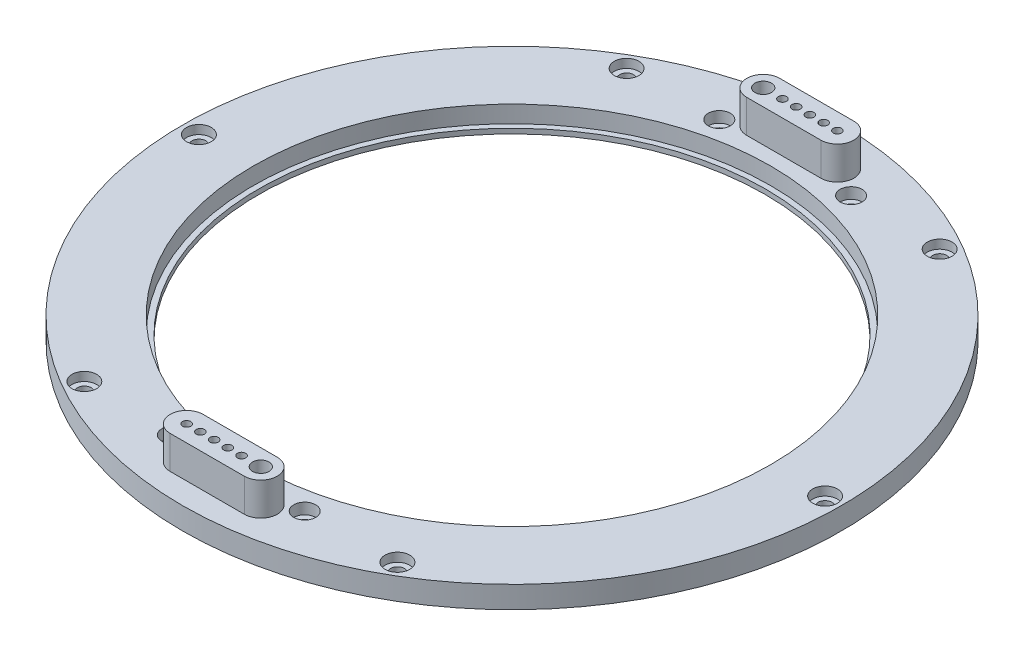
ISO-10303-21;
HEADER;
FILE_DESCRIPTION(('STEP AP214'),'2;1');
FILE_NAME('part.step','',(''),(''),'','','');
FILE_SCHEMA(('AUTOMOTIVE_DESIGN { 1 0 10303 214 1 1 1 1 }'));
ENDSEC;
DATA;
#1=APPLICATION_CONTEXT('core data for automotive mechanical design processes');
#2=APPLICATION_PROTOCOL_DEFINITION('international standard','automotive_design',2000,#1);
#3=PRODUCT_CONTEXT('',#1,'mechanical');
#4=PRODUCT('Part','Part','',(#3));
#5=PRODUCT_RELATED_PRODUCT_CATEGORY('part','',(#4));
#6=PRODUCT_DEFINITION_FORMATION('','',#4);
#7=PRODUCT_DEFINITION_CONTEXT('part definition',#1,'design');
#8=PRODUCT_DEFINITION('design','',#6,#7);
#9=PRODUCT_DEFINITION_SHAPE('','',#8);
#10=(LENGTH_UNIT() NAMED_UNIT(*) SI_UNIT(.MILLI.,.METRE.));
#11=(NAMED_UNIT(*) PLANE_ANGLE_UNIT() SI_UNIT($,.RADIAN.));
#12=(NAMED_UNIT(*) SI_UNIT($,.STERADIAN.) SOLID_ANGLE_UNIT());
#13=UNCERTAINTY_MEASURE_WITH_UNIT(LENGTH_MEASURE(1.E-05),#10,'distance_accuracy_value','');
#14=(GEOMETRIC_REPRESENTATION_CONTEXT(3) GLOBAL_UNCERTAINTY_ASSIGNED_CONTEXT((#13)) GLOBAL_UNIT_ASSIGNED_CONTEXT((#10,
#11,#12)) REPRESENTATION_CONTEXT('',''));
#15=CARTESIAN_POINT('',(0.,0.,0.));
#16=DIRECTION('',(0.,0.,1.));
#17=DIRECTION('',(1.,0.,0.));
#18=AXIS2_PLACEMENT_3D('',#15,#16,#17);
#19=CARTESIAN_POINT('',(0.,4.,0.));
#20=DIRECTION('',(0.,1.,0.));
#21=DIRECTION('',(0.,0.,1.));
#22=AXIS2_PLACEMENT_3D('',#19,#20,#21);
#23=PLANE('',#22);
#24=DIRECTION('',(1.,0.,0.));
#25=VECTOR('',#24,1.);
#26=CARTESIAN_POINT('',(-7.00000000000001,4.,-49.7359346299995));
#27=LINE('',#26,#25);
#28=CARTESIAN_POINT('',(-7.00000000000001,4.,-49.7359346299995));
#29=VERTEX_POINT('',#28);
#30=CARTESIAN_POINT('',(6.49999999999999,4.,-49.7359346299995));
#31=VERTEX_POINT('',#30);
#32=EDGE_CURVE('E167',#29,#31,#27,.T.);
#33=ORIENTED_EDGE('',*,*,#32,.F.);
#34=CARTESIAN_POINT('',(-7.00000000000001,4.,-52.7359346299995));
#35=DIRECTION('',(0.,1.,0.));
#36=DIRECTION('',(0.,0.,1.));
#37=AXIS2_PLACEMENT_3D('',#34,#35,#36);
#38=CIRCLE('',#37,3.);
#39=CARTESIAN_POINT('',(-7.00000000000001,4.,-55.7359346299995));
#40=VERTEX_POINT('',#39);
#41=EDGE_CURVE('E153',#40,#29,#38,.T.);
#42=ORIENTED_EDGE('',*,*,#41,.F.);
#43=DIRECTION('',(-1.,0.,0.));
#44=VECTOR('',#43,1.);
#45=CARTESIAN_POINT('',(-7.00000000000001,4.,-55.7359346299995));
#46=LINE('',#45,#44);
#47=CARTESIAN_POINT('',(6.49999999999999,4.,-55.7359346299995));
#48=VERTEX_POINT('',#47);
#49=EDGE_CURVE('E158',#48,#40,#46,.T.);
#50=ORIENTED_EDGE('',*,*,#49,.F.);
#51=CARTESIAN_POINT('',(6.49999999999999,4.,-52.7359346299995));
#52=DIRECTION('',(0.,1.,0.));
#53=DIRECTION('',(0.,0.,1.));
#54=AXIS2_PLACEMENT_3D('',#51,#52,#53);
#55=CIRCLE('',#54,3.);
#56=EDGE_CURVE('E169',#31,#48,#55,.T.);
#57=ORIENTED_EDGE('',*,*,#56,.F.);
#58=EDGE_LOOP('',(#33,#42,#50,#57));
#59=FACE_BOUND('',#58,.T.);
#60=CARTESIAN_POINT('',(28.5,4.,-49.363448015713));
#61=DIRECTION('',(0.,1.,0.));
#62=DIRECTION('',(0.,0.,1.));
#63=AXIS2_PLACEMENT_3D('',#60,#61,#62);
#64=CIRCLE('',#63,2.25);
#65=CARTESIAN_POINT('',(28.5,4.,-47.113448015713));
#66=VERTEX_POINT('',#65);
#67=EDGE_CURVE('E180',#66,#66,#64,.T.);
#68=ORIENTED_EDGE('',*,*,#67,.F.);
#69=EDGE_LOOP('',(#68));
#70=FACE_BOUND('',#69,.T.);
#71=CARTESIAN_POINT('',(57.,4.,0.));
#72=DIRECTION('',(0.,1.,0.));
#73=DIRECTION('',(0.,0.,1.));
#74=AXIS2_PLACEMENT_3D('',#71,#72,#73);
#75=CIRCLE('',#74,2.25);
#76=CARTESIAN_POINT('',(57.,4.,2.25));
#77=VERTEX_POINT('',#76);
#78=EDGE_CURVE('E203',#77,#77,#75,.T.);
#79=ORIENTED_EDGE('',*,*,#78,.F.);
#80=EDGE_LOOP('',(#79));
#81=FACE_BOUND('',#80,.T.);
#82=CARTESIAN_POINT('',(28.5,4.,49.363448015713));
#83=DIRECTION('',(0.,1.,0.));
#84=DIRECTION('',(0.,0.,1.));
#85=AXIS2_PLACEMENT_3D('',#82,#83,#84);
#86=CIRCLE('',#85,2.25);
#87=CARTESIAN_POINT('',(28.5,4.,51.613448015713));
#88=VERTEX_POINT('',#87);
#89=EDGE_CURVE('E197',#88,#88,#86,.T.);
#90=ORIENTED_EDGE('',*,*,#89,.F.);
#91=EDGE_LOOP('',(#90));
#92=FACE_BOUND('',#91,.T.);
#93=CARTESIAN_POINT('',(-28.5,4.,49.363448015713));
#94=DIRECTION('',(0.,1.,0.));
#95=DIRECTION('',(0.,0.,1.));
#96=AXIS2_PLACEMENT_3D('',#93,#94,#95);
#97=CIRCLE('',#96,2.25);
#98=CARTESIAN_POINT('',(-28.5,4.,51.613448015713));
#99=VERTEX_POINT('',#98);
#100=EDGE_CURVE('E191',#99,#99,#97,.T.);
#101=ORIENTED_EDGE('',*,*,#100,.F.);
#102=EDGE_LOOP('',(#101));
#103=FACE_BOUND('',#102,.T.);
#104=CARTESIAN_POINT('',(-57.,4.,0.));
#105=DIRECTION('',(0.,1.,0.));
#106=DIRECTION('',(0.,0.,1.));
#107=AXIS2_PLACEMENT_3D('',#104,#105,#106);
#108=CIRCLE('',#107,2.25);
#109=CARTESIAN_POINT('',(-57.,4.,2.25));
#110=VERTEX_POINT('',#109);
#111=EDGE_CURVE('E185',#110,#110,#108,.T.);
#112=ORIENTED_EDGE('',*,*,#111,.F.);
#113=EDGE_LOOP('',(#112));
#114=FACE_BOUND('',#113,.T.);
#115=CARTESIAN_POINT('',(-28.5,4.,-49.363448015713));
#116=DIRECTION('',(0.,1.,0.));
#117=DIRECTION('',(0.,0.,1.));
#118=AXIS2_PLACEMENT_3D('',#115,#116,#117);
#119=CIRCLE('',#118,2.25);
#120=CARTESIAN_POINT('',(-28.5,4.,-47.113448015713));
#121=VERTEX_POINT('',#120);
#122=EDGE_CURVE('E184',#121,#121,#119,.T.);
#123=ORIENTED_EDGE('',*,*,#122,.F.);
#124=EDGE_LOOP('',(#123));
#125=FACE_BOUND('',#124,.T.);
#126=CARTESIAN_POINT('',(12.,4.,-49.7359346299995));
#127=DIRECTION('',(0.,-1.,0.));
#128=DIRECTION('',(0.,0.,-1.));
#129=AXIS2_PLACEMENT_3D('',#126,#127,#128);
#130=CIRCLE('',#129,2.);
#131=CARTESIAN_POINT('',(12.,4.,-51.7359346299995));
#132=VERTEX_POINT('',#131);
#133=EDGE_CURVE('E246',#132,#132,#130,.T.);
#134=ORIENTED_EDGE('',*,*,#133,.T.);
#135=EDGE_LOOP('',(#134));
#136=FACE_BOUND('',#135,.T.);
#137=CARTESIAN_POINT('',(-11.9999999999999,4.,49.7359346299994));
#138=DIRECTION('',(0.,-1.,0.));
#139=DIRECTION('',(0.,0.,-1.));
#140=AXIS2_PLACEMENT_3D('',#137,#138,#139);
#141=CIRCLE('',#140,2.);
#142=CARTESIAN_POINT('',(-11.9999999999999,4.,47.7359346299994));
#143=VERTEX_POINT('',#142);
#144=EDGE_CURVE('E239',#143,#143,#141,.T.);
#145=ORIENTED_EDGE('',*,*,#144,.T.);
#146=EDGE_LOOP('',(#145));
#147=FACE_BOUND('',#146,.T.);
#148=CARTESIAN_POINT('',(12.0000000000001,4.,49.7359346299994));
#149=DIRECTION('',(0.,-1.,0.));
#150=DIRECTION('',(0.,0.,-1.));
#151=AXIS2_PLACEMENT_3D('',#148,#149,#150);
#152=CIRCLE('',#151,2.);
#153=CARTESIAN_POINT('',(12.0000000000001,4.,47.7359346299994));
#154=VERTEX_POINT('',#153);
#155=EDGE_CURVE('E220',#154,#154,#152,.T.);
#156=ORIENTED_EDGE('',*,*,#155,.T.);
#157=EDGE_LOOP('',(#156));
#158=FACE_BOUND('',#157,.T.);
#159=CARTESIAN_POINT('',(-12.,4.,-49.7359346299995));
#160=DIRECTION('',(0.,-1.,0.));
#161=DIRECTION('',(0.,0.,-1.));
#162=AXIS2_PLACEMENT_3D('',#159,#160,#161);
#163=CIRCLE('',#162,2.);
#164=CARTESIAN_POINT('',(-12.,4.,-51.7359346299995));
#165=VERTEX_POINT('',#164);
#166=EDGE_CURVE('E245',#165,#165,#163,.T.);
#167=ORIENTED_EDGE('',*,*,#166,.T.);
#168=EDGE_LOOP('',(#167));
#169=FACE_BOUND('',#168,.T.);
#170=CARTESIAN_POINT('',(0.,4.,0.));
#171=DIRECTION('',(0.,1.,0.));
#172=DIRECTION('',(0.,0.,1.));
#173=AXIS2_PLACEMENT_3D('',#170,#171,#172);
#174=CIRCLE('',#173,60.);
#175=CARTESIAN_POINT('',(0.,4.,60.));
#176=VERTEX_POINT('',#175);
#177=EDGE_CURVE('E11',#176,#176,#174,.T.);
#178=ORIENTED_EDGE('',*,*,#177,.T.);
#179=EDGE_LOOP('',(#178));
#180=FACE_BOUND('',#179,.T.);
#181=CARTESIAN_POINT('',(0.,4.,0.));
#182=DIRECTION('',(0.,1.,0.));
#183=DIRECTION('',(0.,0.,1.));
#184=AXIS2_PLACEMENT_3D('',#181,#182,#183);
#185=CIRCLE('',#184,47.1);
#186=CARTESIAN_POINT('',(0.,4.,47.1));
#187=VERTEX_POINT('',#186);
#188=EDGE_CURVE('E318',#187,#187,#185,.T.);
#189=ORIENTED_EDGE('',*,*,#188,.F.);
#190=EDGE_LOOP('',(#189));
#191=FACE_BOUND('',#190,.T.);
#192=DIRECTION('',(-1.,0.,0.));
#193=VECTOR('',#192,1.);
#194=CARTESIAN_POINT('',(7.00000000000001,4.,49.7359346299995));
#195=LINE('',#194,#193);
#196=CARTESIAN_POINT('',(7.00000000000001,4.,49.7359346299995));
#197=VERTEX_POINT('',#196);
#198=CARTESIAN_POINT('',(-6.49999999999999,4.,49.7359346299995));
#199=VERTEX_POINT('',#198);
#200=EDGE_CURVE('E568',#197,#199,#195,.T.);
#201=ORIENTED_EDGE('',*,*,#200,.F.);
#202=CARTESIAN_POINT('',(7.00000000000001,4.,52.7359346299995));
#203=DIRECTION('',(0.,1.,0.));
#204=DIRECTION('',(0.,0.,-1.));
#205=AXIS2_PLACEMENT_3D('',#202,#203,#204);
#206=CIRCLE('',#205,3.);
#207=CARTESIAN_POINT('',(7.00000000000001,4.,55.7359346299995));
#208=VERTEX_POINT('',#207);
#209=EDGE_CURVE('E129',#208,#197,#206,.T.);
#210=ORIENTED_EDGE('',*,*,#209,.F.);
#211=DIRECTION('',(1.,0.,0.));
#212=VECTOR('',#211,1.);
#213=CARTESIAN_POINT('',(7.00000000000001,4.,55.7359346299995));
#214=LINE('',#213,#212);
#215=CARTESIAN_POINT('',(-6.49999999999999,4.,55.7359346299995));
#216=VERTEX_POINT('',#215);
#217=EDGE_CURVE('E125',#216,#208,#214,.T.);
#218=ORIENTED_EDGE('',*,*,#217,.F.);
#219=CARTESIAN_POINT('',(-6.49999999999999,4.,52.7359346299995));
#220=DIRECTION('',(0.,1.,0.));
#221=DIRECTION('',(0.,0.,-1.));
#222=AXIS2_PLACEMENT_3D('',#219,#220,#221);
#223=CIRCLE('',#222,3.);
#224=EDGE_CURVE('E570',#199,#216,#223,.T.);
#225=ORIENTED_EDGE('',*,*,#224,.F.);
#226=EDGE_LOOP('',(#201,#210,#218,#225));
#227=FACE_BOUND('',#226,.T.);
#228=ADVANCED_FACE('F37',(#59,#70,#81,#92,#103,#114,#125,#136,#147,#158,#169,#180,#191,#227),
#23,.T.);
#229=CARTESIAN_POINT('',(-28.5,0.,-49.363448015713));
#230=DIRECTION('',(0.,1.,0.));
#231=DIRECTION('',(0.,0.,1.));
#232=AXIS2_PLACEMENT_3D('',#229,#230,#231);
#233=CYLINDRICAL_SURFACE('',#232,1.25);
#234=CARTESIAN_POINT('',(-28.5,0.,-49.363448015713));
#235=DIRECTION('',(0.,1.,0.));
#236=DIRECTION('',(0.,0.,1.));
#237=AXIS2_PLACEMENT_3D('',#234,#235,#236);
#238=CIRCLE('',#237,1.25);
#239=CARTESIAN_POINT('',(-28.5,0.,-48.113448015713));
#240=VERTEX_POINT('',#239);
#241=EDGE_CURVE('E221',#240,#240,#238,.T.);
#242=ORIENTED_EDGE('',*,*,#241,.F.);
#243=EDGE_LOOP('',(#242));
#244=FACE_BOUND('',#243,.T.);
#245=CARTESIAN_POINT('',(-28.5,2.4,-49.363448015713));
#246=DIRECTION('',(0.,1.,0.));
#247=DIRECTION('',(0.,0.,1.));
#248=AXIS2_PLACEMENT_3D('',#245,#246,#247);
#249=CIRCLE('',#248,1.25);
#250=CARTESIAN_POINT('',(-28.5,2.4,-48.113448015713));
#251=VERTEX_POINT('',#250);
#252=EDGE_CURVE('E41',#251,#251,#249,.F.);
#253=ORIENTED_EDGE('',*,*,#252,.F.);
#254=EDGE_LOOP('',(#253));
#255=FACE_BOUND('',#254,.T.);
#256=ADVANCED_FACE('F352',(#244,#255),#233,.F.);
#257=CARTESIAN_POINT('',(28.5,0.,-49.363448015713));
#258=DIRECTION('',(0.,1.,0.));
#259=DIRECTION('',(0.,0.,1.));
#260=AXIS2_PLACEMENT_3D('',#257,#258,#259);
#261=CYLINDRICAL_SURFACE('',#260,1.24999999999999);
#262=CARTESIAN_POINT('',(28.5,0.,-49.363448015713));
#263=DIRECTION('',(0.,1.,0.));
#264=DIRECTION('',(0.,0.,1.));
#265=AXIS2_PLACEMENT_3D('',#262,#263,#264);
#266=CIRCLE('',#265,1.24999999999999);
#267=CARTESIAN_POINT('',(28.5,0.,-48.113448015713));
#268=VERTEX_POINT('',#267);
#269=EDGE_CURVE('E228',#268,#268,#266,.T.);
#270=ORIENTED_EDGE('',*,*,#269,.F.);
#271=EDGE_LOOP('',(#270));
#272=FACE_BOUND('',#271,.T.);
#273=CARTESIAN_POINT('',(28.5,2.4,-49.363448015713));
#274=DIRECTION('',(0.,1.,0.));
#275=DIRECTION('',(0.,0.,1.));
#276=AXIS2_PLACEMENT_3D('',#273,#274,#275);
#277=CIRCLE('',#276,1.24999999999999);
#278=CARTESIAN_POINT('',(28.5,2.4,-48.113448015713));
#279=VERTEX_POINT('',#278);
#280=EDGE_CURVE('E343',#279,#279,#277,.F.);
#281=ORIENTED_EDGE('',*,*,#280,.F.);
#282=EDGE_LOOP('',(#281));
#283=FACE_BOUND('',#282,.T.);
#284=ADVANCED_FACE('F354',(#272,#283),#261,.F.);
#285=CARTESIAN_POINT('',(57.,0.,0.));
#286=DIRECTION('',(0.,1.,0.));
#287=DIRECTION('',(0.,0.,1.));
#288=AXIS2_PLACEMENT_3D('',#285,#286,#287);
#289=CYLINDRICAL_SURFACE('',#288,1.25);
#290=CARTESIAN_POINT('',(57.,0.,0.));
#291=DIRECTION('',(0.,1.,0.));
#292=DIRECTION('',(0.,0.,1.));
#293=AXIS2_PLACEMENT_3D('',#290,#291,#292);
#294=CIRCLE('',#293,1.25);
#295=CARTESIAN_POINT('',(57.,0.,1.24999999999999));
#296=VERTEX_POINT('',#295);
#297=EDGE_CURVE('E231',#296,#296,#294,.T.);
#298=ORIENTED_EDGE('',*,*,#297,.F.);
#299=EDGE_LOOP('',(#298));
#300=FACE_BOUND('',#299,.T.);
#301=CARTESIAN_POINT('',(57.,2.4,0.));
#302=DIRECTION('',(0.,1.,0.));
#303=DIRECTION('',(0.,0.,1.));
#304=AXIS2_PLACEMENT_3D('',#301,#302,#303);
#305=CIRCLE('',#304,1.25);
#306=CARTESIAN_POINT('',(57.,2.4,1.24999999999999));
#307=VERTEX_POINT('',#306);
#308=EDGE_CURVE('E341',#307,#307,#305,.F.);
#309=ORIENTED_EDGE('',*,*,#308,.F.);
#310=EDGE_LOOP('',(#309));
#311=FACE_BOUND('',#310,.T.);
#312=ADVANCED_FACE('F360',(#300,#311),#289,.F.);
#313=CARTESIAN_POINT('',(28.5,0.,49.363448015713));
#314=DIRECTION('',(0.,1.,0.));
#315=DIRECTION('',(0.,0.,1.));
#316=AXIS2_PLACEMENT_3D('',#313,#314,#315);
#317=CYLINDRICAL_SURFACE('',#316,1.25);
#318=CARTESIAN_POINT('',(28.5,0.,49.363448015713));
#319=DIRECTION('',(0.,1.,0.));
#320=DIRECTION('',(0.,0.,1.));
#321=AXIS2_PLACEMENT_3D('',#318,#319,#320);
#322=CIRCLE('',#321,1.25);
#323=CARTESIAN_POINT('',(28.5,0.,50.613448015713));
#324=VERTEX_POINT('',#323);
#325=EDGE_CURVE('E225',#324,#324,#322,.T.);
#326=ORIENTED_EDGE('',*,*,#325,.F.);
#327=EDGE_LOOP('',(#326));
#328=FACE_BOUND('',#327,.T.);
#329=CARTESIAN_POINT('',(28.5,2.4,49.363448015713));
#330=DIRECTION('',(0.,1.,0.));
#331=DIRECTION('',(0.,0.,1.));
#332=AXIS2_PLACEMENT_3D('',#329,#330,#331);
#333=CIRCLE('',#332,1.25);
#334=CARTESIAN_POINT('',(28.5,2.4,50.613448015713));
#335=VERTEX_POINT('',#334);
#336=EDGE_CURVE('E338',#335,#335,#333,.F.);
#337=ORIENTED_EDGE('',*,*,#336,.F.);
#338=EDGE_LOOP('',(#337));
#339=FACE_BOUND('',#338,.T.);
#340=ADVANCED_FACE('F373',(#328,#339),#317,.F.);
#341=CARTESIAN_POINT('',(-28.5,0.,49.363448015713));
#342=DIRECTION('',(0.,1.,0.));
#343=DIRECTION('',(0.,0.,1.));
#344=AXIS2_PLACEMENT_3D('',#341,#342,#343);
#345=CYLINDRICAL_SURFACE('',#344,1.24999999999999);
#346=CARTESIAN_POINT('',(-28.5,0.,49.363448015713));
#347=DIRECTION('',(0.,1.,0.));
#348=DIRECTION('',(0.,0.,1.));
#349=AXIS2_PLACEMENT_3D('',#346,#347,#348);
#350=CIRCLE('',#349,1.24999999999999);
#351=CARTESIAN_POINT('',(-28.5,0.,50.613448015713));
#352=VERTEX_POINT('',#351);
#353=EDGE_CURVE('E222',#352,#352,#350,.T.);
#354=ORIENTED_EDGE('',*,*,#353,.F.);
#355=EDGE_LOOP('',(#354));
#356=FACE_BOUND('',#355,.T.);
#357=CARTESIAN_POINT('',(-28.5,2.4,49.363448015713));
#358=DIRECTION('',(0.,1.,0.));
#359=DIRECTION('',(0.,0.,1.));
#360=AXIS2_PLACEMENT_3D('',#357,#358,#359);
#361=CIRCLE('',#360,1.24999999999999);
#362=CARTESIAN_POINT('',(-28.5,2.4,50.613448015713));
#363=VERTEX_POINT('',#362);
#364=EDGE_CURVE('E335',#363,#363,#361,.F.);
#365=ORIENTED_EDGE('',*,*,#364,.F.);
#366=EDGE_LOOP('',(#365));
#367=FACE_BOUND('',#366,.T.);
#368=ADVANCED_FACE('F368',(#356,#367),#345,.F.);
#369=CARTESIAN_POINT('',(-57.,0.,0.));
#370=DIRECTION('',(0.,1.,0.));
#371=DIRECTION('',(0.,0.,1.));
#372=AXIS2_PLACEMENT_3D('',#369,#370,#371);
#373=CYLINDRICAL_SURFACE('',#372,1.25);
#374=CARTESIAN_POINT('',(-57.,0.,0.));
#375=DIRECTION('',(0.,1.,0.));
#376=DIRECTION('',(0.,0.,1.));
#377=AXIS2_PLACEMENT_3D('',#374,#375,#376);
#378=CIRCLE('',#377,1.25);
#379=CARTESIAN_POINT('',(-57.,0.,1.25));
#380=VERTEX_POINT('',#379);
#381=EDGE_CURVE('E217',#380,#380,#378,.T.);
#382=ORIENTED_EDGE('',*,*,#381,.F.);
#383=EDGE_LOOP('',(#382));
#384=FACE_BOUND('',#383,.T.);
#385=CARTESIAN_POINT('',(-57.,2.4,0.));
#386=DIRECTION('',(0.,1.,0.));
#387=DIRECTION('',(0.,0.,1.));
#388=AXIS2_PLACEMENT_3D('',#385,#386,#387);
#389=CIRCLE('',#388,1.25);
#390=CARTESIAN_POINT('',(-57.,2.4,1.25));
#391=VERTEX_POINT('',#390);
#392=EDGE_CURVE('E214',#391,#391,#389,.F.);
#393=ORIENTED_EDGE('',*,*,#392,.F.);
#394=EDGE_LOOP('',(#393));
#395=FACE_BOUND('',#394,.T.);
#396=ADVANCED_FACE('F486',(#384,#395),#373,.F.);
#397=CARTESIAN_POINT('',(0.,4.,0.));
#398=DIRECTION('',(0.,-1.,0.));
#399=DIRECTION('',(0.,0.,-1.));
#400=AXIS2_PLACEMENT_3D('',#397,#398,#399);
#401=CYLINDRICAL_SURFACE('',#400,47.1);
#402=ORIENTED_EDGE('',*,*,#188,.T.);
#403=EDGE_LOOP('',(#402));
#404=FACE_BOUND('',#403,.T.);
#405=CARTESIAN_POINT('',(0.,0.9,0.));
#406=DIRECTION('',(0.,-1.,0.));
#407=DIRECTION('',(0.,0.,-1.));
#408=AXIS2_PLACEMENT_3D('',#405,#406,#407);
#409=CIRCLE('',#408,47.1);
#410=CARTESIAN_POINT('',(0.,0.9,-47.1));
#411=VERTEX_POINT('',#410);
#412=EDGE_CURVE('E313',#411,#411,#409,.T.);
#413=ORIENTED_EDGE('',*,*,#412,.T.);
#414=EDGE_LOOP('',(#413));
#415=FACE_BOUND('',#414,.T.);
#416=ADVANCED_FACE('F483',(#404,#415),#401,.F.);
#417=CARTESIAN_POINT('',(0.,0.,0.));
#418=DIRECTION('',(0.,1.,0.));
#419=DIRECTION('',(0.,0.,1.));
#420=AXIS2_PLACEMENT_3D('',#417,#418,#419);
#421=PLANE('',#420);
#422=ORIENTED_EDGE('',*,*,#381,.T.);
#423=EDGE_LOOP('',(#422));
#424=FACE_BOUND('',#423,.T.);
#425=ORIENTED_EDGE('',*,*,#353,.T.);
#426=EDGE_LOOP('',(#425));
#427=FACE_BOUND('',#426,.T.);
#428=ORIENTED_EDGE('',*,*,#325,.T.);
#429=EDGE_LOOP('',(#428));
#430=FACE_BOUND('',#429,.T.);
#431=ORIENTED_EDGE('',*,*,#297,.T.);
#432=EDGE_LOOP('',(#431));
#433=FACE_BOUND('',#432,.T.);
#434=ORIENTED_EDGE('',*,*,#269,.T.);
#435=EDGE_LOOP('',(#434));
#436=FACE_BOUND('',#435,.T.);
#437=ORIENTED_EDGE('',*,*,#241,.T.);
#438=EDGE_LOOP('',(#437));
#439=FACE_BOUND('',#438,.T.);
#440=CARTESIAN_POINT('',(12.,0.,-49.7359346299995));
#441=DIRECTION('',(0.,-1.,0.));
#442=DIRECTION('',(0.,0.,-1.));
#443=AXIS2_PLACEMENT_3D('',#440,#441,#442);
#444=CIRCLE('',#443,1.);
#445=CARTESIAN_POINT('',(12.,0.,-50.7359346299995));
#446=VERTEX_POINT('',#445);
#447=EDGE_CURVE('E265',#446,#446,#444,.T.);
#448=ORIENTED_EDGE('',*,*,#447,.F.);
#449=EDGE_LOOP('',(#448));
#450=FACE_BOUND('',#449,.T.);
#451=CARTESIAN_POINT('',(-11.9999999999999,0.,49.7359346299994));
#452=DIRECTION('',(0.,-1.,0.));
#453=DIRECTION('',(0.,0.,-1.));
#454=AXIS2_PLACEMENT_3D('',#451,#452,#453);
#455=CIRCLE('',#454,1.);
#456=CARTESIAN_POINT('',(-11.9999999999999,0.,48.7359346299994));
#457=VERTEX_POINT('',#456);
#458=EDGE_CURVE('E263',#457,#457,#455,.T.);
#459=ORIENTED_EDGE('',*,*,#458,.F.);
#460=EDGE_LOOP('',(#459));
#461=FACE_BOUND('',#460,.T.);
#462=CARTESIAN_POINT('',(12.0000000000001,0.,49.7359346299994));
#463=DIRECTION('',(0.,-1.,0.));
#464=DIRECTION('',(0.,0.,-1.));
#465=AXIS2_PLACEMENT_3D('',#462,#463,#464);
#466=CIRCLE('',#465,1.);
#467=CARTESIAN_POINT('',(12.0000000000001,0.,48.7359346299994));
#468=VERTEX_POINT('',#467);
#469=EDGE_CURVE('E260',#468,#468,#466,.T.);
#470=ORIENTED_EDGE('',*,*,#469,.F.);
#471=EDGE_LOOP('',(#470));
#472=FACE_BOUND('',#471,.T.);
#473=CARTESIAN_POINT('',(-12.,0.,-49.7359346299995));
#474=DIRECTION('',(0.,-1.,0.));
#475=DIRECTION('',(0.,0.,-1.));
#476=AXIS2_PLACEMENT_3D('',#473,#474,#475);
#477=CIRCLE('',#476,1.);
#478=CARTESIAN_POINT('',(-12.,0.,-50.7359346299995));
#479=VERTEX_POINT('',#478);
#480=EDGE_CURVE('E268',#479,#479,#477,.T.);
#481=ORIENTED_EDGE('',*,*,#480,.F.);
#482=EDGE_LOOP('',(#481));
#483=FACE_BOUND('',#482,.T.);
#484=CARTESIAN_POINT('',(-6.49999999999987,0.,52.7359346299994));
#485=DIRECTION('',(0.,1.,0.));
#486=DIRECTION('',(0.,0.,1.));
#487=AXIS2_PLACEMENT_3D('',#484,#485,#486);
#488=CIRCLE('',#487,0.75);
#489=CARTESIAN_POINT('',(-6.49999999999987,0.,53.4859346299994));
#490=VERTEX_POINT('',#489);
#491=EDGE_CURVE('E289',#490,#490,#488,.T.);
#492=ORIENTED_EDGE('',*,*,#491,.T.);
#493=EDGE_LOOP('',(#492));
#494=FACE_BOUND('',#493,.T.);
#495=CARTESIAN_POINT('',(6.49999999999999,0.,-52.7359346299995));
#496=DIRECTION('',(0.,1.,0.));
#497=DIRECTION('',(0.,0.,1.));
#498=AXIS2_PLACEMENT_3D('',#495,#496,#497);
#499=CIRCLE('',#498,0.750000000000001);
#500=CARTESIAN_POINT('',(6.49999999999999,0.,-51.9859346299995));
#501=VERTEX_POINT('',#500);
#502=EDGE_CURVE('E286',#501,#501,#499,.T.);
#503=ORIENTED_EDGE('',*,*,#502,.T.);
#504=EDGE_LOOP('',(#503));
#505=FACE_BOUND('',#504,.T.);
#506=CARTESIAN_POINT('',(4.,0.,-52.7359346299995));
#507=DIRECTION('',(0.,1.,0.));
#508=DIRECTION('',(0.,0.,1.));
#509=AXIS2_PLACEMENT_3D('',#506,#507,#508);
#510=CIRCLE('',#509,0.749999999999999);
#511=CARTESIAN_POINT('',(4.,0.,-51.9859346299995));
#512=VERTEX_POINT('',#511);
#513=EDGE_CURVE('E283',#512,#512,#510,.T.);
#514=ORIENTED_EDGE('',*,*,#513,.T.);
#515=EDGE_LOOP('',(#514));
#516=FACE_BOUND('',#515,.T.);
#517=CARTESIAN_POINT('',(1.49999999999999,0.,-52.7359346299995));
#518=DIRECTION('',(0.,1.,0.));
#519=DIRECTION('',(0.,0.,1.));
#520=AXIS2_PLACEMENT_3D('',#517,#518,#519);
#521=CIRCLE('',#520,0.750000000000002);
#522=CARTESIAN_POINT('',(1.49999999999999,0.,-51.9859346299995));
#523=VERTEX_POINT('',#522);
#524=EDGE_CURVE('E277',#523,#523,#521,.T.);
#525=ORIENTED_EDGE('',*,*,#524,.T.);
#526=EDGE_LOOP('',(#525));
#527=FACE_BOUND('',#526,.T.);
#528=CARTESIAN_POINT('',(-3.99999999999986,0.,52.7359346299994));
#529=DIRECTION('',(0.,1.,0.));
#530=DIRECTION('',(0.,0.,1.));
#531=AXIS2_PLACEMENT_3D('',#528,#529,#530);
#532=CIRCLE('',#531,0.749999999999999);
#533=CARTESIAN_POINT('',(-3.99999999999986,0.,53.4859346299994));
#534=VERTEX_POINT('',#533);
#535=EDGE_CURVE('E292',#534,#534,#532,.T.);
#536=ORIENTED_EDGE('',*,*,#535,.T.);
#537=EDGE_LOOP('',(#536));
#538=FACE_BOUND('',#537,.T.);
#539=CARTESIAN_POINT('',(-1.49999999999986,0.,52.7359346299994));
#540=DIRECTION('',(0.,1.,0.));
#541=DIRECTION('',(0.,0.,1.));
#542=AXIS2_PLACEMENT_3D('',#539,#540,#541);
#543=CIRCLE('',#542,0.750000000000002);
#544=CARTESIAN_POINT('',(-1.49999999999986,0.,53.4859346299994));
#545=VERTEX_POINT('',#544);
#546=EDGE_CURVE('E302',#545,#545,#543,.T.);
#547=ORIENTED_EDGE('',*,*,#546,.T.);
#548=EDGE_LOOP('',(#547));
#549=FACE_BOUND('',#548,.T.);
#550=CARTESIAN_POINT('',(1.00000000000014,0.,52.7359346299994));
#551=DIRECTION('',(0.,1.,0.));
#552=DIRECTION('',(0.,0.,1.));
#553=AXIS2_PLACEMENT_3D('',#550,#551,#552);
#554=CIRCLE('',#553,0.750000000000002);
#555=CARTESIAN_POINT('',(1.00000000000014,0.,53.4859346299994));
#556=VERTEX_POINT('',#555);
#557=EDGE_CURVE('E299',#556,#556,#554,.T.);
#558=ORIENTED_EDGE('',*,*,#557,.T.);
#559=EDGE_LOOP('',(#558));
#560=FACE_BOUND('',#559,.T.);
#561=CARTESIAN_POINT('',(3.50000000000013,0.,52.7359346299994));
#562=DIRECTION('',(0.,1.,0.));
#563=DIRECTION('',(0.,0.,1.));
#564=AXIS2_PLACEMENT_3D('',#561,#562,#563);
#565=CIRCLE('',#564,0.749999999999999);
#566=CARTESIAN_POINT('',(3.50000000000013,0.,53.4859346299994));
#567=VERTEX_POINT('',#566);
#568=EDGE_CURVE('E295',#567,#567,#565,.T.);
#569=ORIENTED_EDGE('',*,*,#568,.T.);
#570=EDGE_LOOP('',(#569));
#571=FACE_BOUND('',#570,.T.);
#572=CARTESIAN_POINT('',(-1.00000000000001,0.,-52.7359346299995));
#573=DIRECTION('',(0.,1.,0.));
#574=DIRECTION('',(0.,0.,1.));
#575=AXIS2_PLACEMENT_3D('',#572,#573,#574);
#576=CIRCLE('',#575,0.749999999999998);
#577=CARTESIAN_POINT('',(-1.00000000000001,0.,-51.9859346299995));
#578=VERTEX_POINT('',#577);
#579=EDGE_CURVE('E274',#578,#578,#576,.T.);
#580=ORIENTED_EDGE('',*,*,#579,.T.);
#581=EDGE_LOOP('',(#580));
#582=FACE_BOUND('',#581,.T.);
#583=CARTESIAN_POINT('',(-3.5,0.,-52.7359346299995));
#584=DIRECTION('',(0.,1.,0.));
#585=DIRECTION('',(0.,0.,1.));
#586=AXIS2_PLACEMENT_3D('',#583,#584,#585);
#587=CIRCLE('',#586,0.750000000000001);
#588=CARTESIAN_POINT('',(-3.5,0.,-51.9859346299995));
#589=VERTEX_POINT('',#588);
#590=EDGE_CURVE('E278',#589,#589,#587,.T.);
#591=ORIENTED_EDGE('',*,*,#590,.T.);
#592=EDGE_LOOP('',(#591));
#593=FACE_BOUND('',#592,.T.);
#594=CARTESIAN_POINT('',(-7.00000000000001,0.,-52.7359346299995));
#595=DIRECTION('',(0.,1.,0.));
#596=DIRECTION('',(0.,0.,1.));
#597=AXIS2_PLACEMENT_3D('',#594,#595,#596);
#598=CIRCLE('',#597,1.5);
#599=CARTESIAN_POINT('',(-7.00000000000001,0.,-51.2359346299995));
#600=VERTEX_POINT('',#599);
#601=EDGE_CURVE('E273',#600,#600,#598,.T.);
#602=ORIENTED_EDGE('',*,*,#601,.T.);
#603=EDGE_LOOP('',(#602));
#604=FACE_BOUND('',#603,.T.);
#605=CARTESIAN_POINT('',(7.00000000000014,0.,52.7359346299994));
#606=DIRECTION('',(0.,1.,0.));
#607=DIRECTION('',(0.,0.,1.));
#608=AXIS2_PLACEMENT_3D('',#605,#606,#607);
#609=CIRCLE('',#608,1.5);
#610=CARTESIAN_POINT('',(7.00000000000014,0.,54.2359346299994));
#611=VERTEX_POINT('',#610);
#612=EDGE_CURVE('E298',#611,#611,#609,.T.);
#613=ORIENTED_EDGE('',*,*,#612,.T.);
#614=EDGE_LOOP('',(#613));
#615=FACE_BOUND('',#614,.T.);
#616=CARTESIAN_POINT('',(0.,0.,0.));
#617=DIRECTION('',(0.,1.,0.));
#618=DIRECTION('',(0.,0.,1.));
#619=AXIS2_PLACEMENT_3D('',#616,#617,#618);
#620=CIRCLE('',#619,60.);
#621=CARTESIAN_POINT('',(0.,0.,60.));
#622=VERTEX_POINT('',#621);
#623=EDGE_CURVE('E46',#622,#622,#620,.T.);
#624=ORIENTED_EDGE('',*,*,#623,.F.);
#625=EDGE_LOOP('',(#624));
#626=FACE_BOUND('',#625,.T.);
#627=CARTESIAN_POINT('',(0.,0.,0.));
#628=DIRECTION('',(0.,-1.,0.));
#629=DIRECTION('',(0.,0.,-1.));
#630=AXIS2_PLACEMENT_3D('',#627,#628,#629);
#631=CIRCLE('',#630,46.1);
#632=CARTESIAN_POINT('',(0.,0.,-46.1));
#633=VERTEX_POINT('',#632);
#634=EDGE_CURVE('E309',#633,#633,#631,.T.);
#635=ORIENTED_EDGE('',*,*,#634,.F.);
#636=EDGE_LOOP('',(#635));
#637=FACE_BOUND('',#636,.T.);
#638=ADVANCED_FACE('F485',(#424,#427,#430,#433,#436,#439,#450,#461,#472,#483,#494,#505,#516,
#527,#538,#549,#560,#571,#582,#593,#604,#615,#626,#637),#421,.F.);
#639=CARTESIAN_POINT('',(0.,4.,0.));
#640=DIRECTION('',(0.,-1.,0.));
#641=DIRECTION('',(0.,0.,-1.));
#642=AXIS2_PLACEMENT_3D('',#639,#640,#641);
#643=CYLINDRICAL_SURFACE('',#642,60.);
#644=ORIENTED_EDGE('',*,*,#177,.F.);
#645=EDGE_LOOP('',(#644));
#646=FACE_BOUND('',#645,.T.);
#647=ORIENTED_EDGE('',*,*,#623,.T.);
#648=EDGE_LOOP('',(#647));
#649=FACE_BOUND('',#648,.T.);
#650=ADVANCED_FACE('F39',(#646,#649),#643,.T.);
#651=CARTESIAN_POINT('',(0.,0.9,0.));
#652=DIRECTION('',(0.,-1.,0.));
#653=DIRECTION('',(0.,0.,-1.));
#654=AXIS2_PLACEMENT_3D('',#651,#652,#653);
#655=PLANE('',#654);
#656=CARTESIAN_POINT('',(0.,0.9,0.));
#657=DIRECTION('',(0.,-1.,0.));
#658=DIRECTION('',(0.,0.,-1.));
#659=AXIS2_PLACEMENT_3D('',#656,#657,#658);
#660=CIRCLE('',#659,46.1);
#661=CARTESIAN_POINT('',(0.,0.9,-46.1));
#662=VERTEX_POINT('',#661);
#663=EDGE_CURVE('E310',#662,#662,#660,.T.);
#664=ORIENTED_EDGE('',*,*,#663,.T.);
#665=EDGE_LOOP('',(#664));
#666=FACE_BOUND('',#665,.T.);
#667=ORIENTED_EDGE('',*,*,#412,.F.);
#668=EDGE_LOOP('',(#667));
#669=FACE_BOUND('',#668,.T.);
#670=ADVANCED_FACE('F478',(#666,#669),#655,.F.);
#671=CARTESIAN_POINT('',(0.,0.9,0.));
#672=DIRECTION('',(0.,-1.,0.));
#673=DIRECTION('',(0.,0.,-1.));
#674=AXIS2_PLACEMENT_3D('',#671,#672,#673);
#675=CYLINDRICAL_SURFACE('',#674,46.1);
#676=ORIENTED_EDGE('',*,*,#663,.F.);
#677=EDGE_LOOP('',(#676));
#678=FACE_BOUND('',#677,.T.);
#679=ORIENTED_EDGE('',*,*,#634,.T.);
#680=EDGE_LOOP('',(#679));
#681=FACE_BOUND('',#680,.T.);
#682=ADVANCED_FACE('F474',(#678,#681),#675,.F.);
#683=CARTESIAN_POINT('',(7.00000000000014,0.,52.7359346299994));
#684=DIRECTION('',(0.,1.,0.));
#685=DIRECTION('',(0.,0.,1.));
#686=AXIS2_PLACEMENT_3D('',#683,#684,#685);
#687=CYLINDRICAL_SURFACE('',#686,1.5);
#688=ORIENTED_EDGE('',*,*,#612,.F.);
#689=EDGE_LOOP('',(#688));
#690=FACE_BOUND('',#689,.T.);
#691=CARTESIAN_POINT('',(7.00000000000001,10.,52.7359346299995));
#692=DIRECTION('',(0.,1.,0.));
#693=DIRECTION('',(0.,0.,-1.));
#694=AXIS2_PLACEMENT_3D('',#691,#692,#693);
#695=CIRCLE('',#694,1.5);
#696=CARTESIAN_POINT('',(7.00000000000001,10.,51.2359346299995));
#697=VERTEX_POINT('',#696);
#698=EDGE_CURVE('E545',#697,#697,#695,.T.);
#699=ORIENTED_EDGE('',*,*,#698,.T.);
#700=EDGE_LOOP('',(#699));
#701=FACE_BOUND('',#700,.T.);
#702=ADVANCED_FACE('F440',(#690,#701),#687,.F.);
#703=CARTESIAN_POINT('',(-7.00000000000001,0.,-52.7359346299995));
#704=DIRECTION('',(0.,1.,0.));
#705=DIRECTION('',(0.,0.,1.));
#706=AXIS2_PLACEMENT_3D('',#703,#704,#705);
#707=CYLINDRICAL_SURFACE('',#706,1.5);
#708=ORIENTED_EDGE('',*,*,#601,.F.);
#709=EDGE_LOOP('',(#708));
#710=FACE_BOUND('',#709,.T.);
#711=CARTESIAN_POINT('',(-7.00000000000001,10.,-52.7359346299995));
#712=DIRECTION('',(0.,1.,0.));
#713=DIRECTION('',(0.,0.,1.));
#714=AXIS2_PLACEMENT_3D('',#711,#712,#713);
#715=CIRCLE('',#714,1.5);
#716=CARTESIAN_POINT('',(-7.00000000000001,10.,-51.2359346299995));
#717=VERTEX_POINT('',#716);
#718=EDGE_CURVE('E131',#717,#717,#715,.T.);
#719=ORIENTED_EDGE('',*,*,#718,.T.);
#720=EDGE_LOOP('',(#719));
#721=FACE_BOUND('',#720,.T.);
#722=ADVANCED_FACE('F436',(#710,#721),#707,.F.);
#723=CARTESIAN_POINT('',(-3.5,0.,-52.7359346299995));
#724=DIRECTION('',(0.,1.,0.));
#725=DIRECTION('',(0.,0.,1.));
#726=AXIS2_PLACEMENT_3D('',#723,#724,#725);
#727=CYLINDRICAL_SURFACE('',#726,0.750000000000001);
#728=ORIENTED_EDGE('',*,*,#590,.F.);
#729=EDGE_LOOP('',(#728));
#730=FACE_BOUND('',#729,.T.);
#731=CARTESIAN_POINT('',(-3.5,10.,-52.7359346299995));
#732=DIRECTION('',(0.,1.,0.));
#733=DIRECTION('',(0.,0.,1.));
#734=AXIS2_PLACEMENT_3D('',#731,#732,#733);
#735=CIRCLE('',#734,0.750000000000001);
#736=CARTESIAN_POINT('',(-3.5,10.,-51.9859346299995));
#737=VERTEX_POINT('',#736);
#738=EDGE_CURVE('E134',#737,#737,#735,.T.);
#739=ORIENTED_EDGE('',*,*,#738,.T.);
#740=EDGE_LOOP('',(#739));
#741=FACE_BOUND('',#740,.T.);
#742=ADVANCED_FACE('F432',(#730,#741),#727,.F.);
#743=CARTESIAN_POINT('',(-1.00000000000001,0.,-52.7359346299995));
#744=DIRECTION('',(0.,1.,0.));
#745=DIRECTION('',(0.,0.,1.));
#746=AXIS2_PLACEMENT_3D('',#743,#744,#745);
#747=CYLINDRICAL_SURFACE('',#746,0.749999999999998);
#748=ORIENTED_EDGE('',*,*,#579,.F.);
#749=EDGE_LOOP('',(#748));
#750=FACE_BOUND('',#749,.T.);
#751=CARTESIAN_POINT('',(-1.00000000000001,10.,-52.7359346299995));
#752=DIRECTION('',(0.,1.,0.));
#753=DIRECTION('',(0.,0.,1.));
#754=AXIS2_PLACEMENT_3D('',#751,#752,#753);
#755=CIRCLE('',#754,0.750000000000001);
#756=CARTESIAN_POINT('',(-1.00000000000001,10.,-51.9859346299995));
#757=VERTEX_POINT('',#756);
#758=EDGE_CURVE('E141',#757,#757,#755,.T.);
#759=ORIENTED_EDGE('',*,*,#758,.T.);
#760=EDGE_LOOP('',(#759));
#761=FACE_BOUND('',#760,.T.);
#762=ADVANCED_FACE('F428',(#750,#761),#747,.F.);
#763=CARTESIAN_POINT('',(3.50000000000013,0.,52.7359346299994));
#764=DIRECTION('',(0.,1.,0.));
#765=DIRECTION('',(0.,0.,1.));
#766=AXIS2_PLACEMENT_3D('',#763,#764,#765);
#767=CYLINDRICAL_SURFACE('',#766,0.749999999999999);
#768=ORIENTED_EDGE('',*,*,#568,.F.);
#769=EDGE_LOOP('',(#768));
#770=FACE_BOUND('',#769,.T.);
#771=CARTESIAN_POINT('',(3.5,10.,52.7359346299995));
#772=DIRECTION('',(0.,1.,0.));
#773=DIRECTION('',(0.,0.,-1.));
#774=AXIS2_PLACEMENT_3D('',#771,#772,#773);
#775=CIRCLE('',#774,0.750000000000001);
#776=CARTESIAN_POINT('',(3.5,10.,51.9859346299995));
#777=VERTEX_POINT('',#776);
#778=EDGE_CURVE('E547',#777,#777,#775,.T.);
#779=ORIENTED_EDGE('',*,*,#778,.T.);
#780=EDGE_LOOP('',(#779));
#781=FACE_BOUND('',#780,.T.);
#782=ADVANCED_FACE('F431',(#770,#781),#767,.F.);
#783=CARTESIAN_POINT('',(1.00000000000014,0.,52.7359346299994));
#784=DIRECTION('',(0.,1.,0.));
#785=DIRECTION('',(0.,0.,1.));
#786=AXIS2_PLACEMENT_3D('',#783,#784,#785);
#787=CYLINDRICAL_SURFACE('',#786,0.750000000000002);
#788=ORIENTED_EDGE('',*,*,#557,.F.);
#789=EDGE_LOOP('',(#788));
#790=FACE_BOUND('',#789,.T.);
#791=CARTESIAN_POINT('',(1.00000000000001,10.,52.7359346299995));
#792=DIRECTION('',(0.,1.,0.));
#793=DIRECTION('',(0.,0.,-1.));
#794=AXIS2_PLACEMENT_3D('',#791,#792,#793);
#795=CIRCLE('',#794,0.750000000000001);
#796=CARTESIAN_POINT('',(1.00000000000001,10.,51.9859346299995));
#797=VERTEX_POINT('',#796);
#798=EDGE_CURVE('E550',#797,#797,#795,.T.);
#799=ORIENTED_EDGE('',*,*,#798,.T.);
#800=EDGE_LOOP('',(#799));
#801=FACE_BOUND('',#800,.T.);
#802=ADVANCED_FACE('F460',(#790,#801),#787,.F.);
#803=CARTESIAN_POINT('',(-1.49999999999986,0.,52.7359346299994));
#804=DIRECTION('',(0.,1.,0.));
#805=DIRECTION('',(0.,0.,1.));
#806=AXIS2_PLACEMENT_3D('',#803,#804,#805);
#807=CYLINDRICAL_SURFACE('',#806,0.750000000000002);
#808=ORIENTED_EDGE('',*,*,#546,.F.);
#809=EDGE_LOOP('',(#808));
#810=FACE_BOUND('',#809,.T.);
#811=CARTESIAN_POINT('',(-1.49999999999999,10.,52.7359346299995));
#812=DIRECTION('',(0.,1.,0.));
#813=DIRECTION('',(0.,0.,-1.));
#814=AXIS2_PLACEMENT_3D('',#811,#812,#813);
#815=CIRCLE('',#814,0.750000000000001);
#816=CARTESIAN_POINT('',(-1.49999999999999,10.,51.9859346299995));
#817=VERTEX_POINT('',#816);
#818=EDGE_CURVE('E555',#817,#817,#815,.T.);
#819=ORIENTED_EDGE('',*,*,#818,.T.);
#820=EDGE_LOOP('',(#819));
#821=FACE_BOUND('',#820,.T.);
#822=ADVANCED_FACE('F464',(#810,#821),#807,.F.);
#823=CARTESIAN_POINT('',(-3.99999999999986,0.,52.7359346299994));
#824=DIRECTION('',(0.,1.,0.));
#825=DIRECTION('',(0.,0.,1.));
#826=AXIS2_PLACEMENT_3D('',#823,#824,#825);
#827=CYLINDRICAL_SURFACE('',#826,0.749999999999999);
#828=ORIENTED_EDGE('',*,*,#535,.F.);
#829=EDGE_LOOP('',(#828));
#830=FACE_BOUND('',#829,.T.);
#831=CARTESIAN_POINT('',(-4.,10.,52.7359346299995));
#832=DIRECTION('',(0.,1.,0.));
#833=DIRECTION('',(0.,0.,-1.));
#834=AXIS2_PLACEMENT_3D('',#831,#832,#833);
#835=CIRCLE('',#834,0.75);
#836=CARTESIAN_POINT('',(-4.,10.,51.9859346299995));
#837=VERTEX_POINT('',#836);
#838=EDGE_CURVE('E558',#837,#837,#835,.T.);
#839=ORIENTED_EDGE('',*,*,#838,.T.);
#840=EDGE_LOOP('',(#839));
#841=FACE_BOUND('',#840,.T.);
#842=ADVANCED_FACE('F450',(#830,#841),#827,.F.);
#843=CARTESIAN_POINT('',(1.49999999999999,0.,-52.7359346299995));
#844=DIRECTION('',(0.,1.,0.));
#845=DIRECTION('',(0.,0.,1.));
#846=AXIS2_PLACEMENT_3D('',#843,#844,#845);
#847=CYLINDRICAL_SURFACE('',#846,0.750000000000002);
#848=ORIENTED_EDGE('',*,*,#524,.F.);
#849=EDGE_LOOP('',(#848));
#850=FACE_BOUND('',#849,.T.);
#851=CARTESIAN_POINT('',(1.49999999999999,10.,-52.7359346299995));
#852=DIRECTION('',(0.,1.,0.));
#853=DIRECTION('',(0.,0.,1.));
#854=AXIS2_PLACEMENT_3D('',#851,#852,#853);
#855=CIRCLE('',#854,0.750000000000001);
#856=CARTESIAN_POINT('',(1.49999999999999,10.,-51.9859346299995));
#857=VERTEX_POINT('',#856);
#858=EDGE_CURVE('E144',#857,#857,#855,.T.);
#859=ORIENTED_EDGE('',*,*,#858,.T.);
#860=EDGE_LOOP('',(#859));
#861=FACE_BOUND('',#860,.T.);
#862=ADVANCED_FACE('F446',(#850,#861),#847,.F.);
#863=CARTESIAN_POINT('',(4.,0.,-52.7359346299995));
#864=DIRECTION('',(0.,1.,0.));
#865=DIRECTION('',(0.,0.,1.));
#866=AXIS2_PLACEMENT_3D('',#863,#864,#865);
#867=CYLINDRICAL_SURFACE('',#866,0.749999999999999);
#868=ORIENTED_EDGE('',*,*,#513,.F.);
#869=EDGE_LOOP('',(#868));
#870=FACE_BOUND('',#869,.T.);
#871=CARTESIAN_POINT('',(4.,10.,-52.7359346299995));
#872=DIRECTION('',(0.,1.,0.));
#873=DIRECTION('',(0.,0.,1.));
#874=AXIS2_PLACEMENT_3D('',#871,#872,#873);
#875=CIRCLE('',#874,0.75);
#876=CARTESIAN_POINT('',(4.,10.,-51.9859346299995));
#877=VERTEX_POINT('',#876);
#878=EDGE_CURVE('E147',#877,#877,#875,.T.);
#879=ORIENTED_EDGE('',*,*,#878,.T.);
#880=EDGE_LOOP('',(#879));
#881=FACE_BOUND('',#880,.T.);
#882=ADVANCED_FACE('F442',(#870,#881),#867,.F.);
#883=CARTESIAN_POINT('',(6.49999999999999,0.,-52.7359346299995));
#884=DIRECTION('',(0.,1.,0.));
#885=DIRECTION('',(0.,0.,1.));
#886=AXIS2_PLACEMENT_3D('',#883,#884,#885);
#887=CYLINDRICAL_SURFACE('',#886,0.750000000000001);
#888=ORIENTED_EDGE('',*,*,#502,.F.);
#889=EDGE_LOOP('',(#888));
#890=FACE_BOUND('',#889,.T.);
#891=CARTESIAN_POINT('',(6.49999999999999,10.,-52.7359346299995));
#892=DIRECTION('',(0.,1.,0.));
#893=DIRECTION('',(0.,0.,1.));
#894=AXIS2_PLACEMENT_3D('',#891,#892,#893);
#895=CIRCLE('',#894,0.75);
#896=CARTESIAN_POINT('',(6.49999999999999,10.,-51.9859346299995));
#897=VERTEX_POINT('',#896);
#898=EDGE_CURVE('E150',#897,#897,#895,.T.);
#899=ORIENTED_EDGE('',*,*,#898,.T.);
#900=EDGE_LOOP('',(#899));
#901=FACE_BOUND('',#900,.T.);
#902=ADVANCED_FACE('F445',(#890,#901),#887,.F.);
#903=CARTESIAN_POINT('',(-6.49999999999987,0.,52.7359346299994));
#904=DIRECTION('',(0.,1.,0.));
#905=DIRECTION('',(0.,0.,1.));
#906=AXIS2_PLACEMENT_3D('',#903,#904,#905);
#907=CYLINDRICAL_SURFACE('',#906,0.75);
#908=ORIENTED_EDGE('',*,*,#491,.F.);
#909=EDGE_LOOP('',(#908));
#910=FACE_BOUND('',#909,.T.);
#911=CARTESIAN_POINT('',(-6.49999999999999,10.,52.7359346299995));
#912=DIRECTION('',(0.,1.,0.));
#913=DIRECTION('',(0.,0.,-1.));
#914=AXIS2_PLACEMENT_3D('',#911,#912,#913);
#915=CIRCLE('',#914,0.75);
#916=CARTESIAN_POINT('',(-6.49999999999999,10.,51.9859346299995));
#917=VERTEX_POINT('',#916);
#918=EDGE_CURVE('E561',#917,#917,#915,.T.);
#919=ORIENTED_EDGE('',*,*,#918,.T.);
#920=EDGE_LOOP('',(#919));
#921=FACE_BOUND('',#920,.T.);
#922=ADVANCED_FACE('F426',(#910,#921),#907,.F.);
#923=CARTESIAN_POINT('',(-12.,4.,-49.7359346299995));
#924=DIRECTION('',(0.,-1.,0.));
#925=DIRECTION('',(0.,0.,-1.));
#926=AXIS2_PLACEMENT_3D('',#923,#924,#925);
#927=CYLINDRICAL_SURFACE('',#926,1.);
#928=CARTESIAN_POINT('',(-12.,2.,-49.7359346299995));
#929=DIRECTION('',(0.,-1.,0.));
#930=DIRECTION('',(0.,0.,-1.));
#931=AXIS2_PLACEMENT_3D('',#928,#929,#930);
#932=CIRCLE('',#931,1.);
#933=CARTESIAN_POINT('',(-12.,2.,-50.7359346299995));
#934=VERTEX_POINT('',#933);
#935=EDGE_CURVE('E264',#934,#934,#932,.F.);
#936=ORIENTED_EDGE('',*,*,#935,.T.);
#937=EDGE_LOOP('',(#936));
#938=FACE_BOUND('',#937,.T.);
#939=ORIENTED_EDGE('',*,*,#480,.T.);
#940=EDGE_LOOP('',(#939));
#941=FACE_BOUND('',#940,.T.);
#942=ADVANCED_FACE('F416',(#938,#941),#927,.F.);
#943=CARTESIAN_POINT('',(12.0000000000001,4.,49.7359346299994));
#944=DIRECTION('',(0.,-1.,0.));
#945=DIRECTION('',(0.,0.,-1.));
#946=AXIS2_PLACEMENT_3D('',#943,#944,#945);
#947=CYLINDRICAL_SURFACE('',#946,1.);
#948=CARTESIAN_POINT('',(12.0000000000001,2.,49.7359346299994));
#949=DIRECTION('',(0.,-1.,0.));
#950=DIRECTION('',(0.,0.,-1.));
#951=AXIS2_PLACEMENT_3D('',#948,#949,#950);
#952=CIRCLE('',#951,1.);
#953=CARTESIAN_POINT('',(12.0000000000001,2.,48.7359346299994));
#954=VERTEX_POINT('',#953);
#955=EDGE_CURVE('E328',#954,#954,#952,.F.);
#956=ORIENTED_EDGE('',*,*,#955,.T.);
#957=EDGE_LOOP('',(#956));
#958=FACE_BOUND('',#957,.T.);
#959=ORIENTED_EDGE('',*,*,#469,.T.);
#960=EDGE_LOOP('',(#959));
#961=FACE_BOUND('',#960,.T.);
#962=ADVANCED_FACE('F412',(#958,#961),#947,.F.);
#963=CARTESIAN_POINT('',(-11.9999999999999,4.,49.7359346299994));
#964=DIRECTION('',(0.,-1.,0.));
#965=DIRECTION('',(0.,0.,-1.));
#966=AXIS2_PLACEMENT_3D('',#963,#964,#965);
#967=CYLINDRICAL_SURFACE('',#966,1.);
#968=CARTESIAN_POINT('',(-11.9999999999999,2.,49.7359346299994));
#969=DIRECTION('',(0.,-1.,0.));
#970=DIRECTION('',(0.,0.,-1.));
#971=AXIS2_PLACEMENT_3D('',#968,#969,#970);
#972=CIRCLE('',#971,1.);
#973=CARTESIAN_POINT('',(-11.9999999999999,2.,48.7359346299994));
#974=VERTEX_POINT('',#973);
#975=EDGE_CURVE('E325',#974,#974,#972,.F.);
#976=ORIENTED_EDGE('',*,*,#975,.T.);
#977=EDGE_LOOP('',(#976));
#978=FACE_BOUND('',#977,.T.);
#979=ORIENTED_EDGE('',*,*,#458,.T.);
#980=EDGE_LOOP('',(#979));
#981=FACE_BOUND('',#980,.T.);
#982=ADVANCED_FACE('F415',(#978,#981),#967,.F.);
#983=CARTESIAN_POINT('',(12.,4.,-49.7359346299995));
#984=DIRECTION('',(0.,-1.,0.));
#985=DIRECTION('',(0.,0.,-1.));
#986=AXIS2_PLACEMENT_3D('',#983,#984,#985);
#987=CYLINDRICAL_SURFACE('',#986,1.);
#988=CARTESIAN_POINT('',(12.,2.,-49.7359346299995));
#989=DIRECTION('',(0.,-1.,0.));
#990=DIRECTION('',(0.,0.,-1.));
#991=AXIS2_PLACEMENT_3D('',#988,#989,#990);
#992=CIRCLE('',#991,1.);
#993=CARTESIAN_POINT('',(12.,2.,-50.7359346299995));
#994=VERTEX_POINT('',#993);
#995=EDGE_CURVE('E257',#994,#994,#992,.F.);
#996=ORIENTED_EDGE('',*,*,#995,.T.);
#997=EDGE_LOOP('',(#996));
#998=FACE_BOUND('',#997,.T.);
#999=ORIENTED_EDGE('',*,*,#447,.T.);
#1000=EDGE_LOOP('',(#999));
#1001=FACE_BOUND('',#1000,.T.);
#1002=ADVANCED_FACE('F392',(#998,#1001),#987,.F.);
#1003=CARTESIAN_POINT('',(12.,2.,-49.7359346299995));
#1004=DIRECTION('',(0.,-1.,0.));
#1005=DIRECTION('',(0.,0.,-1.));
#1006=AXIS2_PLACEMENT_3D('',#1003,#1004,#1005);
#1007=PLANE('',#1006);
#1008=CARTESIAN_POINT('',(12.,2.,-49.7359346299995));
#1009=DIRECTION('',(0.,-1.,0.));
#1010=DIRECTION('',(0.,0.,-1.));
#1011=AXIS2_PLACEMENT_3D('',#1008,#1009,#1010);
#1012=CIRCLE('',#1011,2.);
#1013=CARTESIAN_POINT('',(12.,2.,-51.7359346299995));
#1014=VERTEX_POINT('',#1013);
#1015=EDGE_CURVE('E242',#1014,#1014,#1012,.T.);
#1016=ORIENTED_EDGE('',*,*,#1015,.F.);
#1017=EDGE_LOOP('',(#1016));
#1018=FACE_BOUND('',#1017,.T.);
#1019=ORIENTED_EDGE('',*,*,#995,.F.);
#1020=EDGE_LOOP('',(#1019));
#1021=FACE_BOUND('',#1020,.T.);
#1022=ADVANCED_FACE('F388',(#1018,#1021),#1007,.F.);
#1023=CARTESIAN_POINT('',(12.,2.,-49.7359346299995));
#1024=DIRECTION('',(0.,1.,0.));
#1025=DIRECTION('',(0.,0.,1.));
#1026=AXIS2_PLACEMENT_3D('',#1023,#1024,#1025);
#1027=CYLINDRICAL_SURFACE('',#1026,2.);
#1028=ORIENTED_EDGE('',*,*,#1015,.T.);
#1029=EDGE_LOOP('',(#1028));
#1030=FACE_BOUND('',#1029,.T.);
#1031=ORIENTED_EDGE('',*,*,#133,.F.);
#1032=EDGE_LOOP('',(#1031));
#1033=FACE_BOUND('',#1032,.T.);
#1034=ADVANCED_FACE('F391',(#1030,#1033),#1027,.F.);
#1035=CARTESIAN_POINT('',(-11.9999999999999,2.,49.7359346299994));
#1036=DIRECTION('',(0.,-1.,0.));
#1037=DIRECTION('',(0.,0.,-1.));
#1038=AXIS2_PLACEMENT_3D('',#1035,#1036,#1037);
#1039=PLANE('',#1038);
#1040=CARTESIAN_POINT('',(-11.9999999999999,2.,49.7359346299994));
#1041=DIRECTION('',(0.,-1.,0.));
#1042=DIRECTION('',(0.,0.,-1.));
#1043=AXIS2_PLACEMENT_3D('',#1040,#1041,#1042);
#1044=CIRCLE('',#1043,2.);
#1045=CARTESIAN_POINT('',(-11.9999999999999,2.,47.7359346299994));
#1046=VERTEX_POINT('',#1045);
#1047=EDGE_CURVE('E249',#1046,#1046,#1044,.T.);
#1048=ORIENTED_EDGE('',*,*,#1047,.F.);
#1049=EDGE_LOOP('',(#1048));
#1050=FACE_BOUND('',#1049,.T.);
#1051=ORIENTED_EDGE('',*,*,#975,.F.);
#1052=EDGE_LOOP('',(#1051));
#1053=FACE_BOUND('',#1052,.T.);
#1054=ADVANCED_FACE('F396',(#1050,#1053),#1039,.F.);
#1055=CARTESIAN_POINT('',(-11.9999999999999,2.,49.7359346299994));
#1056=DIRECTION('',(0.,1.,0.));
#1057=DIRECTION('',(0.,0.,1.));
#1058=AXIS2_PLACEMENT_3D('',#1055,#1056,#1057);
#1059=CYLINDRICAL_SURFACE('',#1058,2.);
#1060=ORIENTED_EDGE('',*,*,#1047,.T.);
#1061=EDGE_LOOP('',(#1060));
#1062=FACE_BOUND('',#1061,.T.);
#1063=ORIENTED_EDGE('',*,*,#144,.F.);
#1064=EDGE_LOOP('',(#1063));
#1065=FACE_BOUND('',#1064,.T.);
#1066=ADVANCED_FACE('F382',(#1062,#1065),#1059,.F.);
#1067=CARTESIAN_POINT('',(12.0000000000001,2.,49.7359346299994));
#1068=DIRECTION('',(0.,-1.,0.));
#1069=DIRECTION('',(0.,0.,-1.));
#1070=AXIS2_PLACEMENT_3D('',#1067,#1068,#1069);
#1071=PLANE('',#1070);
#1072=CARTESIAN_POINT('',(12.0000000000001,2.,49.7359346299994));
#1073=DIRECTION('',(0.,-1.,0.));
#1074=DIRECTION('',(0.,0.,-1.));
#1075=AXIS2_PLACEMENT_3D('',#1072,#1073,#1074);
#1076=CIRCLE('',#1075,2.);
#1077=CARTESIAN_POINT('',(12.0000000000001,2.,47.7359346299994));
#1078=VERTEX_POINT('',#1077);
#1079=EDGE_CURVE('E236',#1078,#1078,#1076,.T.);
#1080=ORIENTED_EDGE('',*,*,#1079,.F.);
#1081=EDGE_LOOP('',(#1080));
#1082=FACE_BOUND('',#1081,.T.);
#1083=ORIENTED_EDGE('',*,*,#955,.F.);
#1084=EDGE_LOOP('',(#1083));
#1085=FACE_BOUND('',#1084,.T.);
#1086=ADVANCED_FACE('F378',(#1082,#1085),#1071,.F.);
#1087=CARTESIAN_POINT('',(12.0000000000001,2.,49.7359346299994));
#1088=DIRECTION('',(0.,1.,0.));
#1089=DIRECTION('',(0.,0.,1.));
#1090=AXIS2_PLACEMENT_3D('',#1087,#1088,#1089);
#1091=CYLINDRICAL_SURFACE('',#1090,2.);
#1092=ORIENTED_EDGE('',*,*,#1079,.T.);
#1093=EDGE_LOOP('',(#1092));
#1094=FACE_BOUND('',#1093,.T.);
#1095=ORIENTED_EDGE('',*,*,#155,.F.);
#1096=EDGE_LOOP('',(#1095));
#1097=FACE_BOUND('',#1096,.T.);
#1098=ADVANCED_FACE('F381',(#1094,#1097),#1091,.F.);
#1099=CARTESIAN_POINT('',(-12.,2.,-49.7359346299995));
#1100=DIRECTION('',(0.,-1.,0.));
#1101=DIRECTION('',(0.,0.,-1.));
#1102=AXIS2_PLACEMENT_3D('',#1099,#1100,#1101);
#1103=PLANE('',#1102);
#1104=CARTESIAN_POINT('',(-12.,2.,-49.7359346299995));
#1105=DIRECTION('',(0.,-1.,0.));
#1106=DIRECTION('',(0.,0.,-1.));
#1107=AXIS2_PLACEMENT_3D('',#1104,#1105,#1106);
#1108=CIRCLE('',#1107,2.);
#1109=CARTESIAN_POINT('',(-12.,2.,-51.7359346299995));
#1110=VERTEX_POINT('',#1109);
#1111=EDGE_CURVE('E254',#1110,#1110,#1108,.T.);
#1112=ORIENTED_EDGE('',*,*,#1111,.F.);
#1113=EDGE_LOOP('',(#1112));
#1114=FACE_BOUND('',#1113,.T.);
#1115=ORIENTED_EDGE('',*,*,#935,.F.);
#1116=EDGE_LOOP('',(#1115));
#1117=FACE_BOUND('',#1116,.T.);
#1118=ADVANCED_FACE('F386',(#1114,#1117),#1103,.F.);
#1119=CARTESIAN_POINT('',(-12.,2.,-49.7359346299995));
#1120=DIRECTION('',(0.,1.,0.));
#1121=DIRECTION('',(0.,0.,1.));
#1122=AXIS2_PLACEMENT_3D('',#1119,#1120,#1121);
#1123=CYLINDRICAL_SURFACE('',#1122,2.);
#1124=ORIENTED_EDGE('',*,*,#1111,.T.);
#1125=EDGE_LOOP('',(#1124));
#1126=FACE_BOUND('',#1125,.T.);
#1127=ORIENTED_EDGE('',*,*,#166,.F.);
#1128=EDGE_LOOP('',(#1127));
#1129=FACE_BOUND('',#1128,.T.);
#1130=ADVANCED_FACE('F406',(#1126,#1129),#1123,.F.);
#1131=CARTESIAN_POINT('',(-57.,2.4,0.));
#1132=DIRECTION('',(0.,1.,0.));
#1133=DIRECTION('',(0.,0.,1.));
#1134=AXIS2_PLACEMENT_3D('',#1131,#1132,#1133);
#1135=PLANE('',#1134);
#1136=CARTESIAN_POINT('',(-57.,2.4,0.));
#1137=DIRECTION('',(0.,1.,0.));
#1138=DIRECTION('',(0.,0.,1.));
#1139=AXIS2_PLACEMENT_3D('',#1136,#1137,#1138);
#1140=CIRCLE('',#1139,2.25);
#1141=CARTESIAN_POINT('',(-57.,2.4,2.25));
#1142=VERTEX_POINT('',#1141);
#1143=EDGE_CURVE('E181',#1142,#1142,#1140,.T.);
#1144=ORIENTED_EDGE('',*,*,#1143,.T.);
#1145=EDGE_LOOP('',(#1144));
#1146=FACE_BOUND('',#1145,.T.);
#1147=ORIENTED_EDGE('',*,*,#392,.T.);
#1148=EDGE_LOOP('',(#1147));
#1149=FACE_BOUND('',#1148,.T.);
#1150=ADVANCED_FACE('F410',(#1146,#1149),#1135,.T.);
#1151=CARTESIAN_POINT('',(-57.,2.4,0.));
#1152=DIRECTION('',(0.,1.,0.));
#1153=DIRECTION('',(0.,0.,1.));
#1154=AXIS2_PLACEMENT_3D('',#1151,#1152,#1153);
#1155=CYLINDRICAL_SURFACE('',#1154,2.25);
#1156=ORIENTED_EDGE('',*,*,#1143,.F.);
#1157=EDGE_LOOP('',(#1156));
#1158=FACE_BOUND('',#1157,.T.);
#1159=ORIENTED_EDGE('',*,*,#111,.T.);
#1160=EDGE_LOOP('',(#1159));
#1161=FACE_BOUND('',#1160,.T.);
#1162=ADVANCED_FACE('F613',(#1158,#1161),#1155,.F.);
#1163=CARTESIAN_POINT('',(-28.5,2.4,49.363448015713));
#1164=DIRECTION('',(0.,1.,0.));
#1165=DIRECTION('',(0.,0.,1.));
#1166=AXIS2_PLACEMENT_3D('',#1163,#1164,#1165);
#1167=PLANE('',#1166);
#1168=CARTESIAN_POINT('',(-28.5,2.4,49.363448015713));
#1169=DIRECTION('',(0.,1.,0.));
#1170=DIRECTION('',(0.,0.,1.));
#1171=AXIS2_PLACEMENT_3D('',#1168,#1169,#1170);
#1172=CIRCLE('',#1171,2.25);
#1173=CARTESIAN_POINT('',(-28.5,2.4,51.613448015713));
#1174=VERTEX_POINT('',#1173);
#1175=EDGE_CURVE('E188',#1174,#1174,#1172,.T.);
#1176=ORIENTED_EDGE('',*,*,#1175,.T.);
#1177=EDGE_LOOP('',(#1176));
#1178=FACE_BOUND('',#1177,.T.);
#1179=ORIENTED_EDGE('',*,*,#364,.T.);
#1180=EDGE_LOOP('',(#1179));
#1181=FACE_BOUND('',#1180,.T.);
#1182=ADVANCED_FACE('F617',(#1178,#1181),#1167,.T.);
#1183=CARTESIAN_POINT('',(-28.5,2.4,49.363448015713));
#1184=DIRECTION('',(0.,1.,0.));
#1185=DIRECTION('',(0.,0.,1.));
#1186=AXIS2_PLACEMENT_3D('',#1183,#1184,#1185);
#1187=CYLINDRICAL_SURFACE('',#1186,2.25);
#1188=ORIENTED_EDGE('',*,*,#1175,.F.);
#1189=EDGE_LOOP('',(#1188));
#1190=FACE_BOUND('',#1189,.T.);
#1191=ORIENTED_EDGE('',*,*,#100,.T.);
#1192=EDGE_LOOP('',(#1191));
#1193=FACE_BOUND('',#1192,.T.);
#1194=ADVANCED_FACE('F621',(#1190,#1193),#1187,.F.);
#1195=CARTESIAN_POINT('',(28.5,2.4,49.363448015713));
#1196=DIRECTION('',(0.,1.,0.));
#1197=DIRECTION('',(0.,0.,1.));
#1198=AXIS2_PLACEMENT_3D('',#1195,#1196,#1197);
#1199=PLANE('',#1198);
#1200=CARTESIAN_POINT('',(28.5,2.4,49.363448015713));
#1201=DIRECTION('',(0.,1.,0.));
#1202=DIRECTION('',(0.,0.,1.));
#1203=AXIS2_PLACEMENT_3D('',#1200,#1201,#1202);
#1204=CIRCLE('',#1203,2.25);
#1205=CARTESIAN_POINT('',(28.5,2.4,51.613448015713));
#1206=VERTEX_POINT('',#1205);
#1207=EDGE_CURVE('E194',#1206,#1206,#1204,.T.);
#1208=ORIENTED_EDGE('',*,*,#1207,.T.);
#1209=EDGE_LOOP('',(#1208));
#1210=FACE_BOUND('',#1209,.T.);
#1211=ORIENTED_EDGE('',*,*,#336,.T.);
#1212=EDGE_LOOP('',(#1211));
#1213=FACE_BOUND('',#1212,.T.);
#1214=ADVANCED_FACE('F625',(#1210,#1213),#1199,.T.);
#1215=CARTESIAN_POINT('',(28.5,2.4,49.363448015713));
#1216=DIRECTION('',(0.,1.,0.));
#1217=DIRECTION('',(0.,0.,1.));
#1218=AXIS2_PLACEMENT_3D('',#1215,#1216,#1217);
#1219=CYLINDRICAL_SURFACE('',#1218,2.25);
#1220=ORIENTED_EDGE('',*,*,#1207,.F.);
#1221=EDGE_LOOP('',(#1220));
#1222=FACE_BOUND('',#1221,.T.);
#1223=ORIENTED_EDGE('',*,*,#89,.T.);
#1224=EDGE_LOOP('',(#1223));
#1225=FACE_BOUND('',#1224,.T.);
#1226=ADVANCED_FACE('F629',(#1222,#1225),#1219,.F.);
#1227=CARTESIAN_POINT('',(57.,2.4,0.));
#1228=DIRECTION('',(0.,1.,0.));
#1229=DIRECTION('',(0.,0.,1.));
#1230=AXIS2_PLACEMENT_3D('',#1227,#1228,#1229);
#1231=PLANE('',#1230);
#1232=CARTESIAN_POINT('',(57.,2.4,0.));
#1233=DIRECTION('',(0.,1.,0.));
#1234=DIRECTION('',(0.,0.,1.));
#1235=AXIS2_PLACEMENT_3D('',#1232,#1233,#1234);
#1236=CIRCLE('',#1235,2.25);
#1237=CARTESIAN_POINT('',(57.,2.4,2.25));
#1238=VERTEX_POINT('',#1237);
#1239=EDGE_CURVE('E200',#1238,#1238,#1236,.T.);
#1240=ORIENTED_EDGE('',*,*,#1239,.T.);
#1241=EDGE_LOOP('',(#1240));
#1242=FACE_BOUND('',#1241,.T.);
#1243=ORIENTED_EDGE('',*,*,#308,.T.);
#1244=EDGE_LOOP('',(#1243));
#1245=FACE_BOUND('',#1244,.T.);
#1246=ADVANCED_FACE('F633',(#1242,#1245),#1231,.T.);
#1247=CARTESIAN_POINT('',(57.,2.4,0.));
#1248=DIRECTION('',(0.,1.,0.));
#1249=DIRECTION('',(0.,0.,1.));
#1250=AXIS2_PLACEMENT_3D('',#1247,#1248,#1249);
#1251=CYLINDRICAL_SURFACE('',#1250,2.25);
#1252=ORIENTED_EDGE('',*,*,#1239,.F.);
#1253=EDGE_LOOP('',(#1252));
#1254=FACE_BOUND('',#1253,.T.);
#1255=ORIENTED_EDGE('',*,*,#78,.T.);
#1256=EDGE_LOOP('',(#1255));
#1257=FACE_BOUND('',#1256,.T.);
#1258=ADVANCED_FACE('F637',(#1254,#1257),#1251,.F.);
#1259=CARTESIAN_POINT('',(28.5,2.4,-49.363448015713));
#1260=DIRECTION('',(0.,1.,0.));
#1261=DIRECTION('',(0.,0.,1.));
#1262=AXIS2_PLACEMENT_3D('',#1259,#1260,#1261);
#1263=PLANE('',#1262);
#1264=CARTESIAN_POINT('',(28.5,2.4,-49.363448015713));
#1265=DIRECTION('',(0.,1.,0.));
#1266=DIRECTION('',(0.,0.,1.));
#1267=AXIS2_PLACEMENT_3D('',#1264,#1265,#1266);
#1268=CIRCLE('',#1267,2.25);
#1269=CARTESIAN_POINT('',(28.5,2.4,-47.113448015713));
#1270=VERTEX_POINT('',#1269);
#1271=EDGE_CURVE('E206',#1270,#1270,#1268,.T.);
#1272=ORIENTED_EDGE('',*,*,#1271,.T.);
#1273=EDGE_LOOP('',(#1272));
#1274=FACE_BOUND('',#1273,.T.);
#1275=ORIENTED_EDGE('',*,*,#280,.T.);
#1276=EDGE_LOOP('',(#1275));
#1277=FACE_BOUND('',#1276,.T.);
#1278=ADVANCED_FACE('F641',(#1274,#1277),#1263,.T.);
#1279=CARTESIAN_POINT('',(28.5,2.4,-49.363448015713));
#1280=DIRECTION('',(0.,1.,0.));
#1281=DIRECTION('',(0.,0.,1.));
#1282=AXIS2_PLACEMENT_3D('',#1279,#1280,#1281);
#1283=CYLINDRICAL_SURFACE('',#1282,2.25);
#1284=ORIENTED_EDGE('',*,*,#1271,.F.);
#1285=EDGE_LOOP('',(#1284));
#1286=FACE_BOUND('',#1285,.T.);
#1287=ORIENTED_EDGE('',*,*,#67,.T.);
#1288=EDGE_LOOP('',(#1287));
#1289=FACE_BOUND('',#1288,.T.);
#1290=ADVANCED_FACE('F645',(#1286,#1289),#1283,.F.);
#1291=CARTESIAN_POINT('',(-28.5,2.4,-49.363448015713));
#1292=DIRECTION('',(0.,1.,0.));
#1293=DIRECTION('',(0.,0.,1.));
#1294=AXIS2_PLACEMENT_3D('',#1291,#1292,#1293);
#1295=PLANE('',#1294);
#1296=CARTESIAN_POINT('',(-28.5,2.4,-49.363448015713));
#1297=DIRECTION('',(0.,1.,0.));
#1298=DIRECTION('',(0.,0.,1.));
#1299=AXIS2_PLACEMENT_3D('',#1296,#1297,#1298);
#1300=CIRCLE('',#1299,2.25);
#1301=CARTESIAN_POINT('',(-28.5,2.4,-47.113448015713));
#1302=VERTEX_POINT('',#1301);
#1303=EDGE_CURVE('E211',#1302,#1302,#1300,.T.);
#1304=ORIENTED_EDGE('',*,*,#1303,.T.);
#1305=EDGE_LOOP('',(#1304));
#1306=FACE_BOUND('',#1305,.T.);
#1307=ORIENTED_EDGE('',*,*,#252,.T.);
#1308=EDGE_LOOP('',(#1307));
#1309=FACE_BOUND('',#1308,.T.);
#1310=ADVANCED_FACE('F350',(#1306,#1309),#1295,.T.);
#1311=CARTESIAN_POINT('',(-28.5,2.4,-49.363448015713));
#1312=DIRECTION('',(0.,1.,0.));
#1313=DIRECTION('',(0.,0.,1.));
#1314=AXIS2_PLACEMENT_3D('',#1311,#1312,#1313);
#1315=CYLINDRICAL_SURFACE('',#1314,2.25);
#1316=ORIENTED_EDGE('',*,*,#1303,.F.);
#1317=EDGE_LOOP('',(#1316));
#1318=FACE_BOUND('',#1317,.T.);
#1319=ORIENTED_EDGE('',*,*,#122,.T.);
#1320=EDGE_LOOP('',(#1319));
#1321=FACE_BOUND('',#1320,.T.);
#1322=ADVANCED_FACE('F595',(#1318,#1321),#1315,.F.);
#1323=CARTESIAN_POINT('',(-7.00000000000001,10.,-52.7359346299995));
#1324=DIRECTION('',(0.,1.,0.));
#1325=DIRECTION('',(0.,0.,1.));
#1326=AXIS2_PLACEMENT_3D('',#1323,#1324,#1325);
#1327=PLANE('',#1326);
#1328=ORIENTED_EDGE('',*,*,#738,.F.);
#1329=EDGE_LOOP('',(#1328));
#1330=FACE_BOUND('',#1329,.T.);
#1331=ORIENTED_EDGE('',*,*,#858,.F.);
#1332=EDGE_LOOP('',(#1331));
#1333=FACE_BOUND('',#1332,.T.);
#1334=ORIENTED_EDGE('',*,*,#898,.F.);
#1335=EDGE_LOOP('',(#1334));
#1336=FACE_BOUND('',#1335,.T.);
#1337=CARTESIAN_POINT('',(-7.00000000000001,10.,-52.7359346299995));
#1338=DIRECTION('',(0.,1.,0.));
#1339=DIRECTION('',(0.,0.,1.));
#1340=AXIS2_PLACEMENT_3D('',#1337,#1338,#1339);
#1341=CIRCLE('',#1340,3.);
#1342=CARTESIAN_POINT('',(-7.00000000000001,10.,-55.7359346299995));
#1343=VERTEX_POINT('',#1342);
#1344=CARTESIAN_POINT('',(-7.00000000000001,10.,-49.7359346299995));
#1345=VERTEX_POINT('',#1344);
#1346=EDGE_CURVE('E154',#1343,#1345,#1341,.T.);
#1347=ORIENTED_EDGE('',*,*,#1346,.T.);
#1348=DIRECTION('',(1.,0.,0.));
#1349=VECTOR('',#1348,1.);
#1350=CARTESIAN_POINT('',(-7.00000000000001,10.,-49.7359346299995));
#1351=LINE('',#1350,#1349);
#1352=CARTESIAN_POINT('',(6.49999999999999,10.,-49.7359346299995));
#1353=VERTEX_POINT('',#1352);
#1354=EDGE_CURVE('E157',#1345,#1353,#1351,.T.);
#1355=ORIENTED_EDGE('',*,*,#1354,.T.);
#1356=CARTESIAN_POINT('',(6.49999999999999,10.,-52.7359346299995));
#1357=DIRECTION('',(0.,1.,0.));
#1358=DIRECTION('',(0.,0.,1.));
#1359=AXIS2_PLACEMENT_3D('',#1356,#1357,#1358);
#1360=CIRCLE('',#1359,3.);
#1361=CARTESIAN_POINT('',(6.49999999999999,10.,-55.7359346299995));
#1362=VERTEX_POINT('',#1361);
#1363=EDGE_CURVE('E160',#1353,#1362,#1360,.T.);
#1364=ORIENTED_EDGE('',*,*,#1363,.T.);
#1365=DIRECTION('',(-1.,0.,0.));
#1366=VECTOR('',#1365,1.);
#1367=CARTESIAN_POINT('',(-7.00000000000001,10.,-55.7359346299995));
#1368=LINE('',#1367,#1366);
#1369=EDGE_CURVE('E162',#1362,#1343,#1368,.T.);
#1370=ORIENTED_EDGE('',*,*,#1369,.T.);
#1371=EDGE_LOOP('',(#1347,#1355,#1364,#1370));
#1372=FACE_BOUND('',#1371,.T.);
#1373=ORIENTED_EDGE('',*,*,#878,.F.);
#1374=EDGE_LOOP('',(#1373));
#1375=FACE_BOUND('',#1374,.T.);
#1376=ORIENTED_EDGE('',*,*,#758,.F.);
#1377=EDGE_LOOP('',(#1376));
#1378=FACE_BOUND('',#1377,.T.);
#1379=ORIENTED_EDGE('',*,*,#718,.F.);
#1380=EDGE_LOOP('',(#1379));
#1381=FACE_BOUND('',#1380,.T.);
#1382=ADVANCED_FACE('F591',(#1330,#1333,#1336,#1372,#1375,#1378,#1381),#1327,.T.);
#1383=CARTESIAN_POINT('',(-7.00000000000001,10.,-52.7359346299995));
#1384=DIRECTION('',(0.,-1.,0.));
#1385=DIRECTION('',(0.,0.,-1.));
#1386=AXIS2_PLACEMENT_3D('',#1383,#1384,#1385);
#1387=CYLINDRICAL_SURFACE('',#1386,3.);
#1388=ORIENTED_EDGE('',*,*,#41,.T.);
#1389=DIRECTION('',(0.,-1.,0.));
#1390=VECTOR('',#1389,1.);
#1391=CARTESIAN_POINT('',(-7.00000000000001,10.,-49.7359346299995));
#1392=LINE('',#1391,#1390);
#1393=EDGE_CURVE('E178',#1345,#29,#1392,.T.);
#1394=ORIENTED_EDGE('',*,*,#1393,.F.);
#1395=ORIENTED_EDGE('',*,*,#1346,.F.);
#1396=DIRECTION('',(0.,-1.,0.));
#1397=VECTOR('',#1396,1.);
#1398=CARTESIAN_POINT('',(-7.00000000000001,10.,-55.7359346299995));
#1399=LINE('',#1398,#1397);
#1400=EDGE_CURVE('E164',#1343,#40,#1399,.T.);
#1401=ORIENTED_EDGE('',*,*,#1400,.T.);
#1402=EDGE_LOOP('',(#1388,#1394,#1395,#1401));
#1403=FACE_BOUND('',#1402,.T.);
#1404=ADVANCED_FACE('F594',(#1403),#1387,.T.);
#1405=CARTESIAN_POINT('',(-7.00000000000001,10.,-49.7359346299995));
#1406=DIRECTION('',(0.,0.,-1.));
#1407=DIRECTION('',(-1.,0.,0.));
#1408=AXIS2_PLACEMENT_3D('',#1405,#1406,#1407);
#1409=PLANE('',#1408);
#1410=ORIENTED_EDGE('',*,*,#32,.T.);
#1411=DIRECTION('',(0.,-1.,0.));
#1412=VECTOR('',#1411,1.);
#1413=CARTESIAN_POINT('',(6.49999999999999,10.,-49.7359346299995));
#1414=LINE('',#1413,#1412);
#1415=EDGE_CURVE('E175',#1353,#31,#1414,.T.);
#1416=ORIENTED_EDGE('',*,*,#1415,.F.);
#1417=ORIENTED_EDGE('',*,*,#1354,.F.);
#1418=ORIENTED_EDGE('',*,*,#1393,.T.);
#1419=EDGE_LOOP('',(#1410,#1416,#1417,#1418));
#1420=FACE_BOUND('',#1419,.T.);
#1421=ADVANCED_FACE('F603',(#1420),#1409,.F.);
#1422=CARTESIAN_POINT('',(6.49999999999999,10.,-52.7359346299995));
#1423=DIRECTION('',(0.,-1.,0.));
#1424=DIRECTION('',(0.,0.,-1.));
#1425=AXIS2_PLACEMENT_3D('',#1422,#1423,#1424);
#1426=CYLINDRICAL_SURFACE('',#1425,3.);
#1427=ORIENTED_EDGE('',*,*,#56,.T.);
#1428=DIRECTION('',(0.,-1.,0.));
#1429=VECTOR('',#1428,1.);
#1430=CARTESIAN_POINT('',(6.49999999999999,10.,-55.7359346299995));
#1431=LINE('',#1430,#1429);
#1432=EDGE_CURVE('E62',#1362,#48,#1431,.T.);
#1433=ORIENTED_EDGE('',*,*,#1432,.F.);
#1434=ORIENTED_EDGE('',*,*,#1363,.F.);
#1435=ORIENTED_EDGE('',*,*,#1415,.T.);
#1436=EDGE_LOOP('',(#1427,#1433,#1434,#1435));
#1437=FACE_BOUND('',#1436,.T.);
#1438=ADVANCED_FACE('F600',(#1437),#1426,.T.);
#1439=CARTESIAN_POINT('',(-7.00000000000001,10.,-55.7359346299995));
#1440=DIRECTION('',(0.,0.,1.));
#1441=DIRECTION('',(1.,0.,0.));
#1442=AXIS2_PLACEMENT_3D('',#1439,#1440,#1441);
#1443=PLANE('',#1442);
#1444=ORIENTED_EDGE('',*,*,#49,.T.);
#1445=ORIENTED_EDGE('',*,*,#1400,.F.);
#1446=ORIENTED_EDGE('',*,*,#1369,.F.);
#1447=ORIENTED_EDGE('',*,*,#1432,.T.);
#1448=EDGE_LOOP('',(#1444,#1445,#1446,#1447));
#1449=FACE_BOUND('',#1448,.T.);
#1450=ADVANCED_FACE('F597',(#1449),#1443,.F.);
#1451=CARTESIAN_POINT('',(7.00000000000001,10.,52.7359346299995));
#1452=DIRECTION('',(0.,1.,0.));
#1453=DIRECTION('',(0.,0.,-1.));
#1454=AXIS2_PLACEMENT_3D('',#1451,#1452,#1453);
#1455=PLANE('',#1454);
#1456=ORIENTED_EDGE('',*,*,#778,.F.);
#1457=EDGE_LOOP('',(#1456));
#1458=FACE_BOUND('',#1457,.T.);
#1459=ORIENTED_EDGE('',*,*,#818,.F.);
#1460=EDGE_LOOP('',(#1459));
#1461=FACE_BOUND('',#1460,.T.);
#1462=ORIENTED_EDGE('',*,*,#918,.F.);
#1463=EDGE_LOOP('',(#1462));
#1464=FACE_BOUND('',#1463,.T.);
#1465=CARTESIAN_POINT('',(7.00000000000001,10.,52.7359346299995));
#1466=DIRECTION('',(0.,1.,0.));
#1467=DIRECTION('',(0.,0.,-1.));
#1468=AXIS2_PLACEMENT_3D('',#1465,#1466,#1467);
#1469=CIRCLE('',#1468,3.);
#1470=CARTESIAN_POINT('',(7.00000000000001,10.,55.7359346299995));
#1471=VERTEX_POINT('',#1470);
#1472=CARTESIAN_POINT('',(7.00000000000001,10.,49.7359346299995));
#1473=VERTEX_POINT('',#1472);
#1474=EDGE_CURVE('E116',#1471,#1473,#1469,.T.);
#1475=ORIENTED_EDGE('',*,*,#1474,.T.);
#1476=DIRECTION('',(-1.,0.,0.));
#1477=VECTOR('',#1476,1.);
#1478=CARTESIAN_POINT('',(7.00000000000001,10.,49.7359346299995));
#1479=LINE('',#1478,#1477);
#1480=CARTESIAN_POINT('',(-6.49999999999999,10.,49.7359346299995));
#1481=VERTEX_POINT('',#1480);
#1482=EDGE_CURVE('E105',#1473,#1481,#1479,.T.);
#1483=ORIENTED_EDGE('',*,*,#1482,.T.);
#1484=CARTESIAN_POINT('',(-6.49999999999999,10.,52.7359346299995));
#1485=DIRECTION('',(0.,1.,0.));
#1486=DIRECTION('',(0.,0.,-1.));
#1487=AXIS2_PLACEMENT_3D('',#1484,#1485,#1486);
#1488=CIRCLE('',#1487,3.);
#1489=CARTESIAN_POINT('',(-6.49999999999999,10.,55.7359346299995));
#1490=VERTEX_POINT('',#1489);
#1491=EDGE_CURVE('E115',#1481,#1490,#1488,.T.);
#1492=ORIENTED_EDGE('',*,*,#1491,.T.);
#1493=DIRECTION('',(1.,0.,0.));
#1494=VECTOR('',#1493,1.);
#1495=CARTESIAN_POINT('',(7.00000000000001,10.,55.7359346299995));
#1496=LINE('',#1495,#1494);
#1497=EDGE_CURVE('E121',#1490,#1471,#1496,.T.);
#1498=ORIENTED_EDGE('',*,*,#1497,.T.);
#1499=EDGE_LOOP('',(#1475,#1483,#1492,#1498));
#1500=FACE_BOUND('',#1499,.T.);
#1501=ORIENTED_EDGE('',*,*,#838,.F.);
#1502=EDGE_LOOP('',(#1501));
#1503=FACE_BOUND('',#1502,.T.);
#1504=ORIENTED_EDGE('',*,*,#798,.F.);
#1505=EDGE_LOOP('',(#1504));
#1506=FACE_BOUND('',#1505,.T.);
#1507=ORIENTED_EDGE('',*,*,#698,.F.);
#1508=EDGE_LOOP('',(#1507));
#1509=FACE_BOUND('',#1508,.T.);
#1510=ADVANCED_FACE('F119',(#1458,#1461,#1464,#1500,#1503,#1506,#1509),#1455,.T.);
#1511=CARTESIAN_POINT('',(7.00000000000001,10.,52.7359346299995));
#1512=DIRECTION('',(0.,-1.,0.));
#1513=DIRECTION('',(0.,0.,-1.));
#1514=AXIS2_PLACEMENT_3D('',#1511,#1512,#1513);
#1515=CYLINDRICAL_SURFACE('',#1514,3.);
#1516=ORIENTED_EDGE('',*,*,#209,.T.);
#1517=DIRECTION('',(0.,-1.,0.));
#1518=VECTOR('',#1517,1.);
#1519=CARTESIAN_POINT('',(7.00000000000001,10.,49.7359346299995));
#1520=LINE('',#1519,#1518);
#1521=EDGE_CURVE('E109',#1473,#197,#1520,.T.);
#1522=ORIENTED_EDGE('',*,*,#1521,.F.);
#1523=ORIENTED_EDGE('',*,*,#1474,.F.);
#1524=DIRECTION('',(0.,-1.,0.));
#1525=VECTOR('',#1524,1.);
#1526=CARTESIAN_POINT('',(7.00000000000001,10.,55.7359346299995));
#1527=LINE('',#1526,#1525);
#1528=EDGE_CURVE('E566',#1471,#208,#1527,.T.);
#1529=ORIENTED_EDGE('',*,*,#1528,.T.);
#1530=EDGE_LOOP('',(#1516,#1522,#1523,#1529));
#1531=FACE_BOUND('',#1530,.T.);
#1532=ADVANCED_FACE('F127',(#1531),#1515,.T.);
#1533=CARTESIAN_POINT('',(7.00000000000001,10.,49.7359346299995));
#1534=DIRECTION('',(0.,0.,1.));
#1535=DIRECTION('',(1.,0.,0.));
#1536=AXIS2_PLACEMENT_3D('',#1533,#1534,#1535);
#1537=PLANE('',#1536);
#1538=ORIENTED_EDGE('',*,*,#200,.T.);
#1539=DIRECTION('',(0.,-1.,0.));
#1540=VECTOR('',#1539,1.);
#1541=CARTESIAN_POINT('',(-6.49999999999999,10.,49.7359346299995));
#1542=LINE('',#1541,#1540);
#1543=EDGE_CURVE('E112',#1481,#199,#1542,.T.);
#1544=ORIENTED_EDGE('',*,*,#1543,.F.);
#1545=ORIENTED_EDGE('',*,*,#1482,.F.);
#1546=ORIENTED_EDGE('',*,*,#1521,.T.);
#1547=EDGE_LOOP('',(#1538,#1544,#1545,#1546));
#1548=FACE_BOUND('',#1547,.T.);
#1549=ADVANCED_FACE('F107',(#1548),#1537,.F.);
#1550=CARTESIAN_POINT('',(-6.49999999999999,10.,52.7359346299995));
#1551=DIRECTION('',(0.,-1.,0.));
#1552=DIRECTION('',(0.,0.,-1.));
#1553=AXIS2_PLACEMENT_3D('',#1550,#1551,#1552);
#1554=CYLINDRICAL_SURFACE('',#1553,3.);
#1555=ORIENTED_EDGE('',*,*,#224,.T.);
#1556=DIRECTION('',(0.,-1.,0.));
#1557=VECTOR('',#1556,1.);
#1558=CARTESIAN_POINT('',(-6.49999999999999,10.,55.7359346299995));
#1559=LINE('',#1558,#1557);
#1560=EDGE_CURVE('E54',#1490,#216,#1559,.T.);
#1561=ORIENTED_EDGE('',*,*,#1560,.F.);
#1562=ORIENTED_EDGE('',*,*,#1491,.F.);
#1563=ORIENTED_EDGE('',*,*,#1543,.T.);
#1564=EDGE_LOOP('',(#1555,#1561,#1562,#1563));
#1565=FACE_BOUND('',#1564,.T.);
#1566=ADVANCED_FACE('F577',(#1565),#1554,.T.);
#1567=CARTESIAN_POINT('',(7.00000000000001,10.,55.7359346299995));
#1568=DIRECTION('',(0.,0.,-1.));
#1569=DIRECTION('',(-1.,0.,0.));
#1570=AXIS2_PLACEMENT_3D('',#1567,#1568,#1569);
#1571=PLANE('',#1570);
#1572=ORIENTED_EDGE('',*,*,#217,.T.);
#1573=ORIENTED_EDGE('',*,*,#1528,.F.);
#1574=ORIENTED_EDGE('',*,*,#1497,.F.);
#1575=ORIENTED_EDGE('',*,*,#1560,.T.);
#1576=EDGE_LOOP('',(#1572,#1573,#1574,#1575));
#1577=FACE_BOUND('',#1576,.T.);
#1578=ADVANCED_FACE('F578',(#1577),#1571,.F.);
#1579=CLOSED_SHELL('',(#228,#256,#284,#312,#340,#368,#396,#416,#638,#650,#670,#682,#702,#722,
#742,#762,#782,#802,#822,#842,#862,#882,#902,#922,#942,#962,#982,#1002,#1022,#1034,#1054,#1066,
#1086,#1098,#1118,#1130,#1150,#1162,#1182,#1194,#1214,#1226,#1246,#1258,#1278,#1290,#1310,#1322,
#1382,#1404,#1421,#1438,#1450,#1510,#1532,#1549,#1566,#1578));
#1580=MANIFOLD_SOLID_BREP('B2',#1579);
#1581=ADVANCED_BREP_SHAPE_REPRESENTATION('',(#18,#1580),#14);
#1582=SHAPE_DEFINITION_REPRESENTATION(#9,#1581);
ENDSEC;
END-ISO-10303-21;
